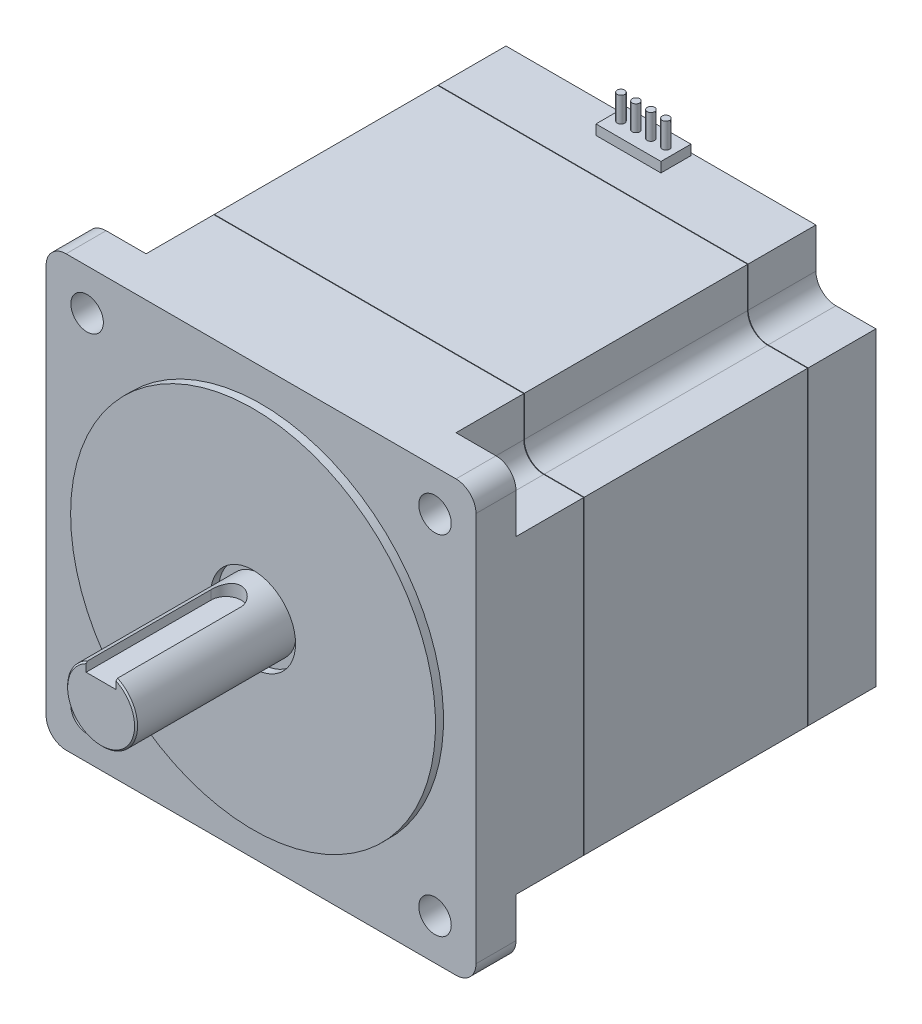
ISO-10303-21;
HEADER;
FILE_DESCRIPTION(('STEP AP214'),'2;1');
FILE_NAME('part.step','',(''),(''),'','','');
FILE_SCHEMA(('AUTOMOTIVE_DESIGN { 1 0 10303 214 1 1 1 1 }'));
ENDSEC;
DATA;
#1=APPLICATION_CONTEXT('core data for automotive mechanical design processes');
#2=APPLICATION_PROTOCOL_DEFINITION('international standard','automotive_design',2000,#1);
#3=PRODUCT_CONTEXT('',#1,'mechanical');
#4=PRODUCT('Part','Part','',(#3));
#5=PRODUCT_RELATED_PRODUCT_CATEGORY('part','',(#4));
#6=PRODUCT_DEFINITION_FORMATION('','',#4);
#7=PRODUCT_DEFINITION_CONTEXT('part definition',#1,'design');
#8=PRODUCT_DEFINITION('design','',#6,#7);
#9=PRODUCT_DEFINITION_SHAPE('','',#8);
#10=(LENGTH_UNIT() NAMED_UNIT(*) SI_UNIT(.MILLI.,.METRE.));
#11=(NAMED_UNIT(*) PLANE_ANGLE_UNIT() SI_UNIT($,.RADIAN.));
#12=(NAMED_UNIT(*) SI_UNIT($,.STERADIAN.) SOLID_ANGLE_UNIT());
#13=UNCERTAINTY_MEASURE_WITH_UNIT(LENGTH_MEASURE(1.E-05),#10,'distance_accuracy_value','');
#14=(GEOMETRIC_REPRESENTATION_CONTEXT(3) GLOBAL_UNCERTAINTY_ASSIGNED_CONTEXT((#13)) GLOBAL_UNIT_ASSIGNED_CONTEXT((#10,
#11,#12)) REPRESENTATION_CONTEXT('',''));
#15=CARTESIAN_POINT('',(0.,0.,0.));
#16=DIRECTION('',(0.,0.,1.));
#17=DIRECTION('',(1.,0.,0.));
#18=AXIS2_PLACEMENT_3D('',#15,#16,#17);
#19=CARTESIAN_POINT('',(-3.,4.5,87.));
#20=DIRECTION('',(0.,-1.,0.));
#21=DIRECTION('',(0.,0.,-1.));
#22=AXIS2_PLACEMENT_3D('',#19,#20,#21);
#23=PLANE('',#22);
#24=DIRECTION('',(0.,0.,-1.));
#25=VECTOR('',#24,1.);
#26=CARTESIAN_POINT('',(3.,4.5,87.));
#27=LINE('',#26,#25);
#28=CARTESIAN_POINT('',(3.,4.5,112.));
#29=VERTEX_POINT('',#28);
#30=CARTESIAN_POINT('',(3.,4.5,87.));
#31=VERTEX_POINT('',#30);
#32=EDGE_CURVE('P0_E370',#29,#31,#27,.T.);
#33=ORIENTED_EDGE('',*,*,#32,.T.);
#34=CARTESIAN_POINT('',(0.,4.5,87.));
#35=DIRECTION('',(0.,-1.,0.));
#36=DIRECTION('',(0.,0.,-1.));
#37=AXIS2_PLACEMENT_3D('',#34,#35,#36);
#38=CIRCLE('',#37,3.);
#39=CARTESIAN_POINT('',(-3.,4.5,87.));
#40=VERTEX_POINT('',#39);
#41=EDGE_CURVE('P0_E369',#31,#40,#38,.F.);
#42=ORIENTED_EDGE('',*,*,#41,.T.);
#43=DIRECTION('',(0.,0.,1.));
#44=VECTOR('',#43,1.);
#45=CARTESIAN_POINT('',(-3.,4.5,87.));
#46=LINE('',#45,#44);
#47=CARTESIAN_POINT('',(-3.,4.5,112.));
#48=VERTEX_POINT('',#47);
#49=EDGE_CURVE('P0_E236',#40,#48,#46,.T.);
#50=ORIENTED_EDGE('',*,*,#49,.T.);
#51=DIRECTION('',(1.,0.,0.));
#52=VECTOR('',#51,1.);
#53=CARTESIAN_POINT('',(0.,4.5,112.));
#54=LINE('',#53,#52);
#55=EDGE_CURVE('P0_E235',#29,#48,#54,.F.);
#56=ORIENTED_EDGE('',*,*,#55,.F.);
#57=EDGE_LOOP('',(#33,#42,#50,#56));
#58=FACE_BOUND('',#57,.T.);
#59=ADVANCED_FACE('P0_F17',(#58),#23,.F.);
#60=CARTESIAN_POINT('',(0.,0.,112.));
#61=DIRECTION('',(0.,0.,1.));
#62=DIRECTION('',(1.,0.,0.));
#63=AXIS2_PLACEMENT_3D('',#60,#61,#62);
#64=PLANE('',#63);
#65=DIRECTION('',(0.,1.,0.));
#66=VECTOR('',#65,1.);
#67=CARTESIAN_POINT('',(3.,4.5,112.));
#68=LINE('',#67,#66);
#69=CARTESIAN_POINT('',(3.,5.99082632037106,112.00000000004));
#70=VERTEX_POINT('',#69);
#71=EDGE_CURVE('P0_E222',#70,#29,#68,.F.);
#72=ORIENTED_EDGE('',*,*,#71,.T.);
#73=ORIENTED_EDGE('',*,*,#55,.T.);
#74=DIRECTION('',(0.,1.,0.));
#75=VECTOR('',#74,1.);
#76=CARTESIAN_POINT('',(-3.,4.5,112.));
#77=LINE('',#76,#75);
#78=CARTESIAN_POINT('',(-3.,5.99082632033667,112.000000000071));
#79=VERTEX_POINT('',#78);
#80=EDGE_CURVE('P0_E228',#48,#79,#77,.T.);
#81=ORIENTED_EDGE('',*,*,#80,.T.);
#82=CARTESIAN_POINT('',(0.,0.,112.00000000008));
#83=DIRECTION('',(0.,0.,-1.));
#84=DIRECTION('',(-1.,0.,0.));
#85=AXIS2_PLACEMENT_3D('',#82,#83,#84);
#86=CIRCLE('',#85,6.70000000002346);
#87=EDGE_CURVE('P0_E211',#70,#79,#86,.T.);
#88=ORIENTED_EDGE('',*,*,#87,.F.);
#89=EDGE_LOOP('',(#72,#73,#81,#88));
#90=FACE_BOUND('',#89,.T.);
#91=ADVANCED_FACE('P0_F233',(#90),#64,.T.);
#92=CARTESIAN_POINT('',(-3.,4.5,87.));
#93=DIRECTION('',(-1.,0.,0.));
#94=DIRECTION('',(0.,0.,1.));
#95=AXIS2_PLACEMENT_3D('',#92,#93,#94);
#96=PLANE('',#95);
#97=CARTESIAN_POINT('',(-3.,5.99082632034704,112.000000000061));
#98=CARTESIAN_POINT('',(-3.,6.04657710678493,111.95014381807));
#99=CARTESIAN_POINT('',(-3.,6.1022632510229,111.900215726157));
#100=CARTESIAN_POINT('',(-3.,6.21350625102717,111.800215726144));
#101=CARTESIAN_POINT('',(-3.,6.26906310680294,111.750143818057));
#102=CARTESIAN_POINT('',(-3.,6.32455532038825,111.700000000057));
#103=B_SPLINE_CURVE_WITH_KNOTS('',3,(#97,#98,#99,#100,#101,#102),.UNSPECIFIED.,.F.,.F.,(4,2,4),
(0.,0.224374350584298,0.448748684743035),.UNSPECIFIED.);
#104=CARTESIAN_POINT('',(-3.,6.3245553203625,111.700000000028));
#105=VERTEX_POINT('',#104);
#106=EDGE_CURVE('P0_E20',#79,#105,#103,.T.);
#107=ORIENTED_EDGE('',*,*,#106,.F.);
#108=ORIENTED_EDGE('',*,*,#80,.F.);
#109=ORIENTED_EDGE('',*,*,#49,.F.);
#110=DIRECTION('',(0.,-1.,0.));
#111=VECTOR('',#110,1.);
#112=CARTESIAN_POINT('',(-3.,43.0000000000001,87.));
#113=LINE('',#112,#111);
#114=CARTESIAN_POINT('',(-3.,6.32455532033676,87.));
#115=VERTEX_POINT('',#114);
#116=EDGE_CURVE('P0_E232',#40,#115,#113,.F.);
#117=ORIENTED_EDGE('',*,*,#116,.T.);
#118=DIRECTION('',(0.,0.,-1.));
#119=VECTOR('',#118,1.);
#120=CARTESIAN_POINT('',(-3.,6.32455532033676,112.));
#121=LINE('',#120,#119);
#122=EDGE_CURVE('P0_E221',#105,#115,#121,.T.);
#123=ORIENTED_EDGE('',*,*,#122,.F.);
#124=EDGE_LOOP('',(#107,#108,#109,#117,#123));
#125=FACE_BOUND('',#124,.T.);
#126=ADVANCED_FACE('P0_F226',(#125),#96,.F.);
#127=CARTESIAN_POINT('',(0.,43.0000000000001,87.));
#128=DIRECTION('',(0.,-1.,0.));
#129=DIRECTION('',(0.,0.,-1.));
#130=AXIS2_PLACEMENT_3D('',#127,#128,#129);
#131=CYLINDRICAL_SURFACE('',#130,3.);
#132=CARTESIAN_POINT('',(-3.,6.32455532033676,87.));
#133=CARTESIAN_POINT('',(-3.00001254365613,6.32453705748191,86.9198488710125));
#134=CARTESIAN_POINT('',(-2.9967882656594,6.32607850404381,86.8397077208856));
#135=CARTESIAN_POINT('',(-2.9839642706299,6.33214408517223,86.6800849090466));
#136=CARTESIAN_POINT('',(-2.97436734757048,6.33666691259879,86.6006029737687));
#137=CARTESIAN_POINT('',(-2.94895223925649,6.34853254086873,86.4432144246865));
#138=CARTESIAN_POINT('',(-2.93316165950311,6.35586282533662,86.3653024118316));
#139=CARTESIAN_POINT('',(-2.89554446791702,6.37308783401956,86.2112563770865));
#140=CARTESIAN_POINT('',(-2.87371740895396,6.38298274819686,86.1351224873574));
#141=CARTESIAN_POINT('',(-2.79955079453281,6.41603222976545,85.9103513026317));
#142=CARTESIAN_POINT('',(-2.73846802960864,6.44258026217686,85.7649927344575));
#143=CARTESIAN_POINT('',(-2.59499047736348,6.5016933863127,85.4865130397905));
#144=CARTESIAN_POINT('',(-2.5125724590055,6.53426502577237,85.3534054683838));
#145=CARTESIAN_POINT('',(-2.32303431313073,6.6041115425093,85.0945542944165));
#146=CARTESIAN_POINT('',(-2.21474157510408,6.64155064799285,84.9697117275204));
#147=CARTESIAN_POINT('',(-1.97898550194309,6.71556929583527,84.7392915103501));
#148=CARTESIAN_POINT('',(-1.85151527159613,6.75214852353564,84.6337208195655));
#149=CARTESIAN_POINT('',(-1.57372168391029,6.82237882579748,84.4400422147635));
#150=CARTESIAN_POINT('',(-1.42260803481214,6.85581277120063,84.3529826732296));
#151=CARTESIAN_POINT('',(-1.10626010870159,6.91389405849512,84.2059856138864));
#152=CARTESIAN_POINT('',(-0.941044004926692,6.93855250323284,84.1460137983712));
#153=CARTESIAN_POINT('',(-0.646111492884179,6.97126052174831,84.067533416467));
#154=CARTESIAN_POINT('',(-0.518448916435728,6.98196994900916,84.0422755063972));
#155=CARTESIAN_POINT('',(-0.260537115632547,6.99634113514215,84.0085076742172));
#156=CARTESIAN_POINT('',(-0.130288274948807,7.00000393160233,83.9999952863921));
#157=CARTESIAN_POINT('',(0.160549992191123,6.99999515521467,84.0000058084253));
#158=CARTESIAN_POINT('',(0.32115986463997,6.99442244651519,84.0129446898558));
#159=CARTESIAN_POINT('',(0.637601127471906,6.97270959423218,84.0641525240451));
#160=CARTESIAN_POINT('',(0.793429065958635,6.95656199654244,84.1024393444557));
#161=CARTESIAN_POINT('',(1.09550948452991,6.91542096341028,84.2026584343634));
#162=CARTESIAN_POINT('',(1.24178723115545,6.89045209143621,84.2645250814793));
#163=CARTESIAN_POINT('',(1.52181125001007,6.83407061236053,84.4098272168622));
#164=CARTESIAN_POINT('',(1.65555532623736,6.80265687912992,84.4932664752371));
#165=CARTESIAN_POINT('',(1.91384294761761,6.73467799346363,84.6839280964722));
#166=CARTESIAN_POINT('',(2.03764209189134,6.69793847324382,84.7920959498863));
#167=CARTESIAN_POINT('',(2.26599158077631,6.62417612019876,85.0271460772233));
#168=CARTESIAN_POINT('',(2.37053147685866,6.58715314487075,85.1540384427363));
#169=CARTESIAN_POINT('',(2.56290495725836,6.51480223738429,85.4310998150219));
#170=CARTESIAN_POINT('',(2.64955184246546,6.47966968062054,85.5821487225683));
#171=CARTESIAN_POINT('',(2.79579228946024,6.41793579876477,85.8982823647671));
#172=CARTESIAN_POINT('',(2.85542690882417,6.39132154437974,86.0633453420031));
#173=CARTESIAN_POINT('',(2.93318733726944,6.35591858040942,86.3573721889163));
#174=CARTESIAN_POINT('',(2.95814548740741,6.34426746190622,86.4842031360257));
#175=CARTESIAN_POINT('',(2.98320565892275,6.33250047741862,86.6764592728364));
#176=CARTESIAN_POINT('',(2.9894962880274,6.32952965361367,86.7409498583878));
#177=CARTESIAN_POINT('',(2.99789576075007,6.32555376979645,86.8702874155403));
#178=CARTESIAN_POINT('',(3.00000301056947,6.32454945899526,86.9351345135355));
#179=CARTESIAN_POINT('',(3.,6.32455532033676,87.));
#180=B_SPLINE_CURVE_WITH_KNOTS('',3,(#132,#133,#134,#135,#136,#137,#138,#139,#140,#141,#142,
#143,#144,#145,#146,#147,#148,#149,#150,#151,#152,#153,#154,#155,#156,#157,#158,#159,#160,#161,
#162,#163,#164,#165,#166,#167,#168,#169,#170,#171,#172,#173,#174,#175,#176,#177,#178,#179),
.UNSPECIFIED.,.F.,.F.,(4,2,2,2,2,2,2,2,2,2,2,2,2,2,2,2,2,2,2,2,2,2,2,4),(0.,0.240357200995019,
0.480609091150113,0.719802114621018,0.959012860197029,1.43637496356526,1.91425904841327,
2.42040481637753,2.9267330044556,3.45675530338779,3.98610460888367,4.376622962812,
4.76708381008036,5.2482359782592,5.72972767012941,6.20988904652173,6.69013439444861,
7.19331431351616,7.69676641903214,8.22703925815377,8.75650337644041,9.14455775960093,
9.33900251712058,9.53352134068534),.UNSPECIFIED.);
#181=CARTESIAN_POINT('',(3.,6.32455532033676,87.));
#182=VERTEX_POINT('',#181);
#183=EDGE_CURVE('P0_E342',#115,#182,#180,.T.);
#184=ORIENTED_EDGE('',*,*,#183,.F.);
#185=ORIENTED_EDGE('',*,*,#116,.F.);
#186=ORIENTED_EDGE('',*,*,#41,.F.);
#187=DIRECTION('',(0.,1.,0.));
#188=VECTOR('',#187,1.);
#189=CARTESIAN_POINT('',(3.,4.5,87.));
#190=LINE('',#189,#188);
#191=EDGE_CURVE('P0_E368',#31,#182,#190,.T.);
#192=ORIENTED_EDGE('',*,*,#191,.T.);
#193=EDGE_LOOP('',(#184,#185,#186,#192));
#194=FACE_BOUND('',#193,.T.);
#195=ADVANCED_FACE('P0_F350',(#194),#131,.F.);
#196=CARTESIAN_POINT('',(3.,4.5,87.));
#197=DIRECTION('',(1.,0.,0.));
#198=DIRECTION('',(0.,0.,-1.));
#199=AXIS2_PLACEMENT_3D('',#196,#197,#198);
#200=PLANE('',#199);
#201=CARTESIAN_POINT('',(3.,6.32455532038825,111.700000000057));
#202=CARTESIAN_POINT('',(3.,6.26906310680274,111.750143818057));
#203=CARTESIAN_POINT('',(3.,6.21350625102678,111.800215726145));
#204=CARTESIAN_POINT('',(3.,6.10226325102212,111.900215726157));
#205=CARTESIAN_POINT('',(3.,6.04657710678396,111.950143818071));
#206=CARTESIAN_POINT('',(3.,5.99082632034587,112.000000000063));
#207=B_SPLINE_CURVE_WITH_KNOTS('',3,(#201,#202,#203,#204,#205,#206),.UNSPECIFIED.,.F.,.F.,(4,2,
4),(0.,0.224374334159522,0.448748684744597),.UNSPECIFIED.);
#208=CARTESIAN_POINT('',(3.,6.3245553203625,111.700000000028));
#209=VERTEX_POINT('',#208);
#210=EDGE_CURVE('P0_E216',#209,#70,#207,.T.);
#211=ORIENTED_EDGE('',*,*,#210,.F.);
#212=DIRECTION('',(0.,0.,-1.));
#213=VECTOR('',#212,1.);
#214=CARTESIAN_POINT('',(3.,6.32455532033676,112.));
#215=LINE('',#214,#213);
#216=EDGE_CURVE('P0_E348',#182,#209,#215,.F.);
#217=ORIENTED_EDGE('',*,*,#216,.F.);
#218=ORIENTED_EDGE('',*,*,#191,.F.);
#219=ORIENTED_EDGE('',*,*,#32,.F.);
#220=ORIENTED_EDGE('',*,*,#71,.F.);
#221=EDGE_LOOP('',(#211,#217,#218,#219,#220));
#222=FACE_BOUND('',#221,.T.);
#223=ADVANCED_FACE('P0_F362',(#222),#200,.F.);
#224=CARTESIAN_POINT('',(0.,0.,111.700000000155));
#225=DIRECTION('',(0.,0.,-1.));
#226=DIRECTION('',(-1.,0.,0.));
#227=AXIS2_PLACEMENT_3D('',#224,#225,#226);
#228=CONICAL_SURFACE('',#227,6.99999999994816,0.785398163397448);
#229=ORIENTED_EDGE('',*,*,#87,.T.);
#230=ORIENTED_EDGE('',*,*,#106,.T.);
#231=CARTESIAN_POINT('',(0.,0.,111.7));
#232=DIRECTION('',(0.,0.,-1.));
#233=DIRECTION('',(-1.,0.,0.));
#234=AXIS2_PLACEMENT_3D('',#231,#232,#233);
#235=CIRCLE('',#234,7.);
#236=EDGE_CURVE('P0_E341',#209,#105,#235,.T.);
#237=ORIENTED_EDGE('',*,*,#236,.F.);
#238=ORIENTED_EDGE('',*,*,#210,.T.);
#239=EDGE_LOOP('',(#229,#230,#237,#238));
#240=FACE_BOUND('',#239,.T.);
#241=ADVANCED_FACE('P0_F213',(#240),#228,.T.);
#242=CARTESIAN_POINT('',(0.,0.,112.));
#243=DIRECTION('',(0.,0.,-1.));
#244=DIRECTION('',(-1.,0.,0.));
#245=AXIS2_PLACEMENT_3D('',#242,#243,#244);
#246=CYLINDRICAL_SURFACE('',#245,7.);
#247=ORIENTED_EDGE('',*,*,#216,.T.);
#248=ORIENTED_EDGE('',*,*,#236,.T.);
#249=ORIENTED_EDGE('',*,*,#122,.T.);
#250=ORIENTED_EDGE('',*,*,#183,.T.);
#251=EDGE_LOOP('',(#247,#248,#249,#250));
#252=FACE_BOUND('',#251,.T.);
#253=CARTESIAN_POINT('',(0.,0.,80.));
#254=DIRECTION('',(0.,0.,-1.));
#255=DIRECTION('',(-1.,0.,0.));
#256=AXIS2_PLACEMENT_3D('',#253,#254,#255);
#257=CIRCLE('',#256,7.);
#258=CARTESIAN_POINT('',(-7.,0.,80.));
#259=VERTEX_POINT('',#258);
#260=EDGE_CURVE('P0_E338',#259,#259,#257,.F.);
#261=ORIENTED_EDGE('',*,*,#260,.T.);
#262=EDGE_LOOP('',(#261));
#263=FACE_BOUND('',#262,.T.);
#264=ADVANCED_FACE('P0_F353',(#252,#263),#246,.T.);
#265=CARTESIAN_POINT('',(31.0000000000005,-30.9999999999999,80.));
#266=DIRECTION('',(0.,0.,-1.));
#267=DIRECTION('',(-1.,0.,0.));
#268=AXIS2_PLACEMENT_3D('',#265,#266,#267);
#269=PLANE('',#268);
#270=ORIENTED_EDGE('',*,*,#260,.F.);
#271=EDGE_LOOP('',(#270));
#272=FACE_BOUND('',#271,.T.);
#273=CARTESIAN_POINT('',(0.,0.,80.));
#274=DIRECTION('',(0.,0.,1.));
#275=DIRECTION('',(1.,0.,0.));
#276=AXIS2_PLACEMENT_3D('',#273,#274,#275);
#277=CIRCLE('',#276,8.5);
#278=CARTESIAN_POINT('',(8.5,0.,80.));
#279=VERTEX_POINT('',#278);
#280=EDGE_CURVE('P0_E335',#279,#279,#277,.T.);
#281=ORIENTED_EDGE('',*,*,#280,.T.);
#282=EDGE_LOOP('',(#281));
#283=FACE_BOUND('',#282,.T.);
#284=ADVANCED_FACE('P0_F357',(#272,#283),#269,.F.);
#285=CARTESIAN_POINT('',(0.,0.,55.9583694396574));
#286=DIRECTION('',(0.,0.,1.));
#287=DIRECTION('',(1.,0.,0.));
#288=AXIS2_PLACEMENT_3D('',#285,#286,#287);
#289=CYLINDRICAL_SURFACE('',#288,8.5);
#290=CARTESIAN_POINT('',(0.,0.,81.6));
#291=DIRECTION('',(0.,0.,1.));
#292=DIRECTION('',(1.,0.,0.));
#293=AXIS2_PLACEMENT_3D('',#290,#291,#292);
#294=CIRCLE('',#293,8.5);
#295=CARTESIAN_POINT('',(8.5,0.,81.6));
#296=VERTEX_POINT('',#295);
#297=EDGE_CURVE('P0_E332',#296,#296,#294,.F.);
#298=ORIENTED_EDGE('',*,*,#297,.F.);
#299=EDGE_LOOP('',(#298));
#300=FACE_BOUND('',#299,.T.);
#301=ORIENTED_EDGE('',*,*,#280,.F.);
#302=EDGE_LOOP('',(#301));
#303=FACE_BOUND('',#302,.T.);
#304=ADVANCED_FACE('P0_F769',(#300,#303),#289,.F.);
#305=CARTESIAN_POINT('',(0.,0.,81.6));
#306=DIRECTION('',(0.,0.,1.));
#307=DIRECTION('',(1.,0.,0.));
#308=AXIS2_PLACEMENT_3D('',#305,#306,#307);
#309=PLANE('',#308);
#310=CARTESIAN_POINT('',(0.,0.,81.6));
#311=DIRECTION('',(0.,0.,-1.));
#312=DIRECTION('',(-1.,0.,0.));
#313=AXIS2_PLACEMENT_3D('',#310,#311,#312);
#314=CIRCLE('',#313,36.5);
#315=CARTESIAN_POINT('',(-36.5,0.,81.6));
#316=VERTEX_POINT('',#315);
#317=EDGE_CURVE('P0_E329',#316,#316,#314,.T.);
#318=ORIENTED_EDGE('',*,*,#317,.F.);
#319=EDGE_LOOP('',(#318));
#320=FACE_BOUND('',#319,.T.);
#321=ORIENTED_EDGE('',*,*,#297,.T.);
#322=EDGE_LOOP('',(#321));
#323=FACE_BOUND('',#322,.T.);
#324=ADVANCED_FACE('P0_F766',(#320,#323),#309,.T.);
#325=CARTESIAN_POINT('',(-34.8,-34.8,0.));
#326=DIRECTION('',(0.,0.,1.));
#327=DIRECTION('',(1.,0.,0.));
#328=AXIS2_PLACEMENT_3D('',#325,#326,#327);
#329=CYLINDRICAL_SURFACE('',#328,3.25);
#330=CARTESIAN_POINT('',(-34.8,-34.8,72.));
#331=DIRECTION('',(0.,0.,1.));
#332=DIRECTION('',(1.,0.,0.));
#333=AXIS2_PLACEMENT_3D('',#330,#331,#332);
#334=CIRCLE('',#333,3.25);
#335=CARTESIAN_POINT('',(-31.55,-34.8,72.));
#336=VERTEX_POINT('',#335);
#337=EDGE_CURVE('P0_E311',#336,#336,#334,.F.);
#338=ORIENTED_EDGE('',*,*,#337,.T.);
#339=EDGE_LOOP('',(#338));
#340=FACE_BOUND('',#339,.T.);
#341=CARTESIAN_POINT('',(-34.8,-34.8,80.));
#342=DIRECTION('',(0.,0.,1.));
#343=DIRECTION('',(1.,0.,0.));
#344=AXIS2_PLACEMENT_3D('',#341,#342,#343);
#345=CIRCLE('',#344,3.25);
#346=CARTESIAN_POINT('',(-31.55,-34.8,80.));
#347=VERTEX_POINT('',#346);
#348=EDGE_CURVE('P0_E306',#347,#347,#345,.T.);
#349=ORIENTED_EDGE('',*,*,#348,.T.);
#350=EDGE_LOOP('',(#349));
#351=FACE_BOUND('',#350,.T.);
#352=ADVANCED_FACE('P0_F762',(#340,#351),#329,.F.);
#353=CARTESIAN_POINT('',(34.8,-34.8,0.));
#354=DIRECTION('',(0.,0.,1.));
#355=DIRECTION('',(1.,0.,0.));
#356=AXIS2_PLACEMENT_3D('',#353,#354,#355);
#357=CYLINDRICAL_SURFACE('',#356,3.25);
#358=CARTESIAN_POINT('',(34.8,-34.8,72.));
#359=DIRECTION('',(0.,0.,1.));
#360=DIRECTION('',(1.,0.,0.));
#361=AXIS2_PLACEMENT_3D('',#358,#359,#360);
#362=CIRCLE('',#361,3.25);
#363=CARTESIAN_POINT('',(38.05,-34.8,72.));
#364=VERTEX_POINT('',#363);
#365=EDGE_CURVE('P0_E316',#364,#364,#362,.F.);
#366=ORIENTED_EDGE('',*,*,#365,.T.);
#367=EDGE_LOOP('',(#366));
#368=FACE_BOUND('',#367,.T.);
#369=CARTESIAN_POINT('',(34.8,-34.8,80.));
#370=DIRECTION('',(0.,0.,1.));
#371=DIRECTION('',(1.,0.,0.));
#372=AXIS2_PLACEMENT_3D('',#369,#370,#371);
#373=CIRCLE('',#372,3.25);
#374=CARTESIAN_POINT('',(38.05,-34.8,80.));
#375=VERTEX_POINT('',#374);
#376=EDGE_CURVE('P0_E303',#375,#375,#373,.T.);
#377=ORIENTED_EDGE('',*,*,#376,.T.);
#378=EDGE_LOOP('',(#377));
#379=FACE_BOUND('',#378,.T.);
#380=ADVANCED_FACE('P0_F758',(#368,#379),#357,.F.);
#381=CARTESIAN_POINT('',(34.8,34.8,0.));
#382=DIRECTION('',(0.,0.,1.));
#383=DIRECTION('',(1.,0.,0.));
#384=AXIS2_PLACEMENT_3D('',#381,#382,#383);
#385=CYLINDRICAL_SURFACE('',#384,3.25);
#386=CARTESIAN_POINT('',(34.8,34.8,72.));
#387=DIRECTION('',(0.,0.,1.));
#388=DIRECTION('',(1.,0.,0.));
#389=AXIS2_PLACEMENT_3D('',#386,#387,#388);
#390=CIRCLE('',#389,3.25);
#391=CARTESIAN_POINT('',(38.05,34.8,72.));
#392=VERTEX_POINT('',#391);
#393=EDGE_CURVE('P0_E326',#392,#392,#390,.F.);
#394=ORIENTED_EDGE('',*,*,#393,.T.);
#395=EDGE_LOOP('',(#394));
#396=FACE_BOUND('',#395,.T.);
#397=CARTESIAN_POINT('',(34.8,34.8,80.));
#398=DIRECTION('',(0.,0.,1.));
#399=DIRECTION('',(1.,0.,0.));
#400=AXIS2_PLACEMENT_3D('',#397,#398,#399);
#401=CIRCLE('',#400,3.25);
#402=CARTESIAN_POINT('',(38.05,34.8,80.));
#403=VERTEX_POINT('',#402);
#404=EDGE_CURVE('P0_E300',#403,#403,#401,.T.);
#405=ORIENTED_EDGE('',*,*,#404,.T.);
#406=EDGE_LOOP('',(#405));
#407=FACE_BOUND('',#406,.T.);
#408=ADVANCED_FACE('P0_F754',(#396,#407),#385,.F.);
#409=CARTESIAN_POINT('',(-34.8,34.8,0.));
#410=DIRECTION('',(0.,0.,1.));
#411=DIRECTION('',(1.,0.,0.));
#412=AXIS2_PLACEMENT_3D('',#409,#410,#411);
#413=CYLINDRICAL_SURFACE('',#412,3.25);
#414=CARTESIAN_POINT('',(-34.8,34.8,72.));
#415=DIRECTION('',(0.,0.,1.));
#416=DIRECTION('',(1.,0.,0.));
#417=AXIS2_PLACEMENT_3D('',#414,#415,#416);
#418=CIRCLE('',#417,3.25);
#419=CARTESIAN_POINT('',(-31.55,34.8,72.));
#420=VERTEX_POINT('',#419);
#421=EDGE_CURVE('P0_E321',#420,#420,#418,.F.);
#422=ORIENTED_EDGE('',*,*,#421,.T.);
#423=EDGE_LOOP('',(#422));
#424=FACE_BOUND('',#423,.T.);
#425=CARTESIAN_POINT('',(-34.8,34.8,80.));
#426=DIRECTION('',(0.,0.,1.));
#427=DIRECTION('',(1.,0.,0.));
#428=AXIS2_PLACEMENT_3D('',#425,#426,#427);
#429=CIRCLE('',#428,3.25);
#430=CARTESIAN_POINT('',(-31.55,34.8,80.));
#431=VERTEX_POINT('',#430);
#432=EDGE_CURVE('P0_E297',#431,#431,#429,.T.);
#433=ORIENTED_EDGE('',*,*,#432,.T.);
#434=EDGE_LOOP('',(#433));
#435=FACE_BOUND('',#434,.T.);
#436=ADVANCED_FACE('P0_F750',(#424,#435),#413,.F.);
#437=CARTESIAN_POINT('',(0.,0.,81.6));
#438=DIRECTION('',(0.,0.,-1.));
#439=DIRECTION('',(-1.,0.,0.));
#440=AXIS2_PLACEMENT_3D('',#437,#438,#439);
#441=CYLINDRICAL_SURFACE('',#440,36.5);
#442=ORIENTED_EDGE('',*,*,#317,.T.);
#443=EDGE_LOOP('',(#442));
#444=FACE_BOUND('',#443,.T.);
#445=CARTESIAN_POINT('',(0.,0.,80.));
#446=DIRECTION('',(0.,0.,-1.));
#447=DIRECTION('',(-1.,0.,0.));
#448=AXIS2_PLACEMENT_3D('',#445,#446,#447);
#449=CIRCLE('',#448,36.5);
#450=CARTESIAN_POINT('',(-36.5,0.,80.));
#451=VERTEX_POINT('',#450);
#452=EDGE_CURVE('P0_E283',#451,#451,#449,.F.);
#453=ORIENTED_EDGE('',*,*,#452,.T.);
#454=EDGE_LOOP('',(#453));
#455=FACE_BOUND('',#454,.T.);
#456=ADVANCED_FACE('P0_F746',(#444,#455),#441,.T.);
#457=CARTESIAN_POINT('',(-43.,-43.,72.));
#458=DIRECTION('',(0.,0.,1.));
#459=DIRECTION('',(1.,0.,0.));
#460=AXIS2_PLACEMENT_3D('',#457,#458,#459);
#461=PLANE('',#460);
#462=CARTESIAN_POINT('',(38.9999999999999,39.,72.));
#463=DIRECTION('',(0.,0.,1.));
#464=DIRECTION('',(1.,0.,0.));
#465=AXIS2_PLACEMENT_3D('',#462,#463,#464);
#466=CIRCLE('',#465,4.);
#467=CARTESIAN_POINT('',(42.9999999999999,39.,72.));
#468=VERTEX_POINT('',#467);
#469=CARTESIAN_POINT('',(38.9999999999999,43.,72.));
#470=VERTEX_POINT('',#469);
#471=EDGE_CURVE('P0_E324',#468,#470,#466,.T.);
#472=ORIENTED_EDGE('',*,*,#471,.F.);
#473=DIRECTION('',(0.,-1.,0.));
#474=VECTOR('',#473,1.);
#475=CARTESIAN_POINT('',(42.9999999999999,30.9999999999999,72.));
#476=LINE('',#475,#474);
#477=CARTESIAN_POINT('',(42.9999999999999,30.9999999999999,72.));
#478=VERTEX_POINT('',#477);
#479=EDGE_CURVE('P0_E413',#468,#478,#476,.T.);
#480=ORIENTED_EDGE('',*,*,#479,.T.);
#481=DIRECTION('',(1.,0.,0.));
#482=VECTOR('',#481,1.);
#483=CARTESIAN_POINT('',(30.9999999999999,30.9999999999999,72.));
#484=LINE('',#483,#482);
#485=CARTESIAN_POINT('',(34.9999999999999,30.9999999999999,72.));
#486=VERTEX_POINT('',#485);
#487=EDGE_CURVE('P0_E417',#478,#486,#484,.F.);
#488=ORIENTED_EDGE('',*,*,#487,.T.);
#489=CARTESIAN_POINT('',(34.9999999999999,35.,72.));
#490=DIRECTION('',(0.,0.,1.));
#491=DIRECTION('',(1.,0.,0.));
#492=AXIS2_PLACEMENT_3D('',#489,#490,#491);
#493=CIRCLE('',#492,4.);
#494=CARTESIAN_POINT('',(30.9999999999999,34.9999999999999,72.));
#495=VERTEX_POINT('',#494);
#496=EDGE_CURVE('P0_E273',#486,#495,#493,.F.);
#497=ORIENTED_EDGE('',*,*,#496,.T.);
#498=DIRECTION('',(0.,-1.,0.));
#499=VECTOR('',#498,1.);
#500=CARTESIAN_POINT('',(30.9999999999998,43.,72.));
#501=LINE('',#500,#499);
#502=CARTESIAN_POINT('',(30.9999999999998,43.,72.));
#503=VERTEX_POINT('',#502);
#504=EDGE_CURVE('P0_E430',#495,#503,#501,.F.);
#505=ORIENTED_EDGE('',*,*,#504,.T.);
#506=DIRECTION('',(1.,0.,0.));
#507=VECTOR('',#506,1.);
#508=CARTESIAN_POINT('',(-31.0000000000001,43.,72.));
#509=LINE('',#508,#507);
#510=EDGE_CURVE('P0_E435',#503,#470,#509,.T.);
#511=ORIENTED_EDGE('',*,*,#510,.T.);
#512=EDGE_LOOP('',(#472,#480,#488,#497,#505,#511));
#513=FACE_BOUND('',#512,.T.);
#514=ORIENTED_EDGE('',*,*,#393,.F.);
#515=EDGE_LOOP('',(#514));
#516=FACE_BOUND('',#515,.T.);
#517=ADVANCED_FACE('P0_F742',(#513,#516),#461,.F.);
#518=CARTESIAN_POINT('',(38.9999999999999,39.,80.));
#519=DIRECTION('',(0.,0.,1.));
#520=DIRECTION('',(1.,0.,0.));
#521=AXIS2_PLACEMENT_3D('',#518,#519,#520);
#522=CYLINDRICAL_SURFACE('',#521,4.);
#523=CARTESIAN_POINT('',(38.9999999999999,39.,80.));
#524=DIRECTION('',(0.,0.,1.));
#525=DIRECTION('',(1.,0.,0.));
#526=AXIS2_PLACEMENT_3D('',#523,#524,#525);
#527=CIRCLE('',#526,4.);
#528=CARTESIAN_POINT('',(38.9999999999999,43.,80.));
#529=VERTEX_POINT('',#528);
#530=CARTESIAN_POINT('',(42.9999999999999,39.,80.));
#531=VERTEX_POINT('',#530);
#532=EDGE_CURVE('P0_E291',#529,#531,#527,.F.);
#533=ORIENTED_EDGE('',*,*,#532,.T.);
#534=DIRECTION('',(0.,0.,1.));
#535=VECTOR('',#534,1.);
#536=CARTESIAN_POINT('',(42.9999999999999,39.,80.));
#537=LINE('',#536,#535);
#538=EDGE_CURVE('P0_E410',#531,#468,#537,.F.);
#539=ORIENTED_EDGE('',*,*,#538,.T.);
#540=ORIENTED_EDGE('',*,*,#471,.T.);
#541=DIRECTION('',(0.,0.,1.));
#542=VECTOR('',#541,1.);
#543=CARTESIAN_POINT('',(38.9999999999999,43.,80.));
#544=LINE('',#543,#542);
#545=EDGE_CURVE('P0_E438',#470,#529,#544,.T.);
#546=ORIENTED_EDGE('',*,*,#545,.T.);
#547=EDGE_LOOP('',(#533,#539,#540,#546));
#548=FACE_BOUND('',#547,.T.);
#549=ADVANCED_FACE('P0_F738',(#548),#522,.T.);
#550=CARTESIAN_POINT('',(-43.,-43.,72.));
#551=DIRECTION('',(0.,0.,1.));
#552=DIRECTION('',(1.,0.,0.));
#553=AXIS2_PLACEMENT_3D('',#550,#551,#552);
#554=PLANE('',#553);
#555=CARTESIAN_POINT('',(-39.0000000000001,39.,72.));
#556=DIRECTION('',(0.,0.,1.));
#557=DIRECTION('',(1.,0.,0.));
#558=AXIS2_PLACEMENT_3D('',#555,#556,#557);
#559=CIRCLE('',#558,4.);
#560=CARTESIAN_POINT('',(-39.0000000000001,43.,72.));
#561=VERTEX_POINT('',#560);
#562=CARTESIAN_POINT('',(-43.0000000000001,39.,72.));
#563=VERTEX_POINT('',#562);
#564=EDGE_CURVE('P0_E319',#561,#563,#559,.T.);
#565=ORIENTED_EDGE('',*,*,#564,.F.);
#566=DIRECTION('',(1.,0.,0.));
#567=VECTOR('',#566,1.);
#568=CARTESIAN_POINT('',(-31.0000000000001,43.,72.));
#569=LINE('',#568,#567);
#570=CARTESIAN_POINT('',(-31.0000000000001,43.0000000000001,72.));
#571=VERTEX_POINT('',#570);
#572=EDGE_CURVE('P0_E443',#561,#571,#569,.T.);
#573=ORIENTED_EDGE('',*,*,#572,.T.);
#574=DIRECTION('',(0.,1.,0.));
#575=VECTOR('',#574,1.);
#576=CARTESIAN_POINT('',(-31.0000000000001,30.9999999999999,72.));
#577=LINE('',#576,#575);
#578=CARTESIAN_POINT('',(-31.0000000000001,34.9999999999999,72.));
#579=VERTEX_POINT('',#578);
#580=EDGE_CURVE('P0_E447',#571,#579,#577,.F.);
#581=ORIENTED_EDGE('',*,*,#580,.T.);
#582=CARTESIAN_POINT('',(-35.0000000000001,34.9999999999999,72.));
#583=DIRECTION('',(0.,0.,1.));
#584=DIRECTION('',(1.,0.,0.));
#585=AXIS2_PLACEMENT_3D('',#582,#583,#584);
#586=CIRCLE('',#585,4.);
#587=CARTESIAN_POINT('',(-35.0000000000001,30.9999999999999,72.));
#588=VERTEX_POINT('',#587);
#589=EDGE_CURVE('P0_E268',#579,#588,#586,.F.);
#590=ORIENTED_EDGE('',*,*,#589,.T.);
#591=DIRECTION('',(1.,0.,0.));
#592=VECTOR('',#591,1.);
#593=CARTESIAN_POINT('',(-43.0000000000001,30.9999999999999,72.));
#594=LINE('',#593,#592);
#595=CARTESIAN_POINT('',(-43.0000000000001,30.9999999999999,72.));
#596=VERTEX_POINT('',#595);
#597=EDGE_CURVE('P0_E460',#588,#596,#594,.F.);
#598=ORIENTED_EDGE('',*,*,#597,.T.);
#599=DIRECTION('',(0.,1.,0.));
#600=VECTOR('',#599,1.);
#601=CARTESIAN_POINT('',(-43.0000000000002,-30.9999999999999,72.));
#602=LINE('',#601,#600);
#603=EDGE_CURVE('P0_E465',#596,#563,#602,.T.);
#604=ORIENTED_EDGE('',*,*,#603,.T.);
#605=EDGE_LOOP('',(#565,#573,#581,#590,#598,#604));
#606=FACE_BOUND('',#605,.T.);
#607=ORIENTED_EDGE('',*,*,#421,.F.);
#608=EDGE_LOOP('',(#607));
#609=FACE_BOUND('',#608,.T.);
#610=ADVANCED_FACE('P0_F734',(#606,#609),#554,.F.);
#611=CARTESIAN_POINT('',(-39.0000000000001,39.,80.));
#612=DIRECTION('',(0.,0.,1.));
#613=DIRECTION('',(1.,0.,0.));
#614=AXIS2_PLACEMENT_3D('',#611,#612,#613);
#615=CYLINDRICAL_SURFACE('',#614,4.);
#616=CARTESIAN_POINT('',(-39.0000000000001,39.,80.));
#617=DIRECTION('',(0.,0.,1.));
#618=DIRECTION('',(1.,0.,0.));
#619=AXIS2_PLACEMENT_3D('',#616,#617,#618);
#620=CIRCLE('',#619,4.);
#621=CARTESIAN_POINT('',(-43.0000000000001,39.,80.));
#622=VERTEX_POINT('',#621);
#623=CARTESIAN_POINT('',(-39.0000000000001,43.,80.));
#624=VERTEX_POINT('',#623);
#625=EDGE_CURVE('P0_E294',#622,#624,#620,.F.);
#626=ORIENTED_EDGE('',*,*,#625,.T.);
#627=DIRECTION('',(0.,0.,1.));
#628=VECTOR('',#627,1.);
#629=CARTESIAN_POINT('',(-39.0000000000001,43.,80.));
#630=LINE('',#629,#628);
#631=EDGE_CURVE('P0_E440',#624,#561,#630,.F.);
#632=ORIENTED_EDGE('',*,*,#631,.T.);
#633=ORIENTED_EDGE('',*,*,#564,.T.);
#634=DIRECTION('',(0.,0.,1.));
#635=VECTOR('',#634,1.);
#636=CARTESIAN_POINT('',(-43.0000000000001,39.,80.));
#637=LINE('',#636,#635);
#638=EDGE_CURVE('P0_E468',#563,#622,#637,.T.);
#639=ORIENTED_EDGE('',*,*,#638,.T.);
#640=EDGE_LOOP('',(#626,#632,#633,#639));
#641=FACE_BOUND('',#640,.T.);
#642=ADVANCED_FACE('P0_F730',(#641),#615,.T.);
#643=CARTESIAN_POINT('',(39.0000000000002,-39.,80.));
#644=DIRECTION('',(0.,0.,1.));
#645=DIRECTION('',(1.,0.,0.));
#646=AXIS2_PLACEMENT_3D('',#643,#644,#645);
#647=CYLINDRICAL_SURFACE('',#646,4.);
#648=CARTESIAN_POINT('',(39.0000000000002,-39.,80.));
#649=DIRECTION('',(0.,0.,1.));
#650=DIRECTION('',(1.,0.,0.));
#651=AXIS2_PLACEMENT_3D('',#648,#649,#650);
#652=CIRCLE('',#651,4.);
#653=CARTESIAN_POINT('',(43.0000000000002,-39.,80.));
#654=VERTEX_POINT('',#653);
#655=CARTESIAN_POINT('',(39.0000000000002,-43.,80.));
#656=VERTEX_POINT('',#655);
#657=EDGE_CURVE('P0_E288',#654,#656,#652,.F.);
#658=ORIENTED_EDGE('',*,*,#657,.T.);
#659=DIRECTION('',(0.,0.,1.));
#660=VECTOR('',#659,1.);
#661=CARTESIAN_POINT('',(39.0000000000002,-43.,80.));
#662=LINE('',#661,#660);
#663=CARTESIAN_POINT('',(39.0000000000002,-43.,72.));
#664=VERTEX_POINT('',#663);
#665=EDGE_CURVE('P0_E494',#656,#664,#662,.F.);
#666=ORIENTED_EDGE('',*,*,#665,.T.);
#667=CARTESIAN_POINT('',(39.0000000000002,-39.,72.));
#668=DIRECTION('',(0.,0.,1.));
#669=DIRECTION('',(1.,0.,0.));
#670=AXIS2_PLACEMENT_3D('',#667,#668,#669);
#671=CIRCLE('',#670,4.);
#672=CARTESIAN_POINT('',(43.0000000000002,-39.,72.));
#673=VERTEX_POINT('',#672);
#674=EDGE_CURVE('P0_E314',#664,#673,#671,.T.);
#675=ORIENTED_EDGE('',*,*,#674,.T.);
#676=DIRECTION('',(0.,0.,1.));
#677=VECTOR('',#676,1.);
#678=CARTESIAN_POINT('',(43.0000000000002,-39.,80.));
#679=LINE('',#678,#677);
#680=EDGE_CURVE('P0_E408',#673,#654,#679,.T.);
#681=ORIENTED_EDGE('',*,*,#680,.T.);
#682=EDGE_LOOP('',(#658,#666,#675,#681));
#683=FACE_BOUND('',#682,.T.);
#684=ADVANCED_FACE('P0_F726',(#683),#647,.T.);
#685=CARTESIAN_POINT('',(-43.,-43.,72.));
#686=DIRECTION('',(0.,0.,1.));
#687=DIRECTION('',(1.,0.,0.));
#688=AXIS2_PLACEMENT_3D('',#685,#686,#687);
#689=PLANE('',#688);
#690=ORIENTED_EDGE('',*,*,#674,.F.);
#691=DIRECTION('',(1.,0.,0.));
#692=VECTOR('',#691,1.);
#693=CARTESIAN_POINT('',(30.9999999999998,-43.,72.));
#694=LINE('',#693,#692);
#695=CARTESIAN_POINT('',(30.9999999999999,-43.,72.));
#696=VERTEX_POINT('',#695);
#697=EDGE_CURVE('P0_E490',#664,#696,#694,.F.);
#698=ORIENTED_EDGE('',*,*,#697,.T.);
#699=DIRECTION('',(0.,-1.,0.));
#700=VECTOR('',#699,1.);
#701=CARTESIAN_POINT('',(31.0000000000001,-30.9999999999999,72.));
#702=LINE('',#701,#700);
#703=CARTESIAN_POINT('',(31.,-34.9999999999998,72.));
#704=VERTEX_POINT('',#703);
#705=EDGE_CURVE('P0_E282',#696,#704,#702,.F.);
#706=ORIENTED_EDGE('',*,*,#705,.T.);
#707=CARTESIAN_POINT('',(35.,-34.9999999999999,72.));
#708=DIRECTION('',(0.,0.,1.));
#709=DIRECTION('',(1.,0.,0.));
#710=AXIS2_PLACEMENT_3D('',#707,#708,#709);
#711=CIRCLE('',#710,4.);
#712=CARTESIAN_POINT('',(35.,-30.9999999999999,72.));
#713=VERTEX_POINT('',#712);
#714=EDGE_CURVE('P0_E278',#704,#713,#711,.F.);
#715=ORIENTED_EDGE('',*,*,#714,.T.);
#716=DIRECTION('',(-1.,0.,0.));
#717=VECTOR('',#716,1.);
#718=CARTESIAN_POINT('',(43.0000000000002,-30.9999999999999,72.));
#719=LINE('',#718,#717);
#720=CARTESIAN_POINT('',(43.0000000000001,-30.9999999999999,72.));
#721=VERTEX_POINT('',#720);
#722=EDGE_CURVE('P0_E400',#713,#721,#719,.F.);
#723=ORIENTED_EDGE('',*,*,#722,.T.);
#724=DIRECTION('',(0.,-1.,0.));
#725=VECTOR('',#724,1.);
#726=CARTESIAN_POINT('',(42.9999999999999,30.9999999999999,72.));
#727=LINE('',#726,#725);
#728=EDGE_CURVE('P0_E405',#721,#673,#727,.T.);
#729=ORIENTED_EDGE('',*,*,#728,.T.);
#730=EDGE_LOOP('',(#690,#698,#706,#715,#723,#729));
#731=FACE_BOUND('',#730,.T.);
#732=ORIENTED_EDGE('',*,*,#365,.F.);
#733=EDGE_LOOP('',(#732));
#734=FACE_BOUND('',#733,.T.);
#735=ADVANCED_FACE('P0_F722',(#731,#734),#689,.F.);
#736=CARTESIAN_POINT('',(-43.,-43.,72.));
#737=DIRECTION('',(0.,0.,1.));
#738=DIRECTION('',(1.,0.,0.));
#739=AXIS2_PLACEMENT_3D('',#736,#737,#738);
#740=PLANE('',#739);
#741=CARTESIAN_POINT('',(-39.0000000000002,-39.,72.));
#742=DIRECTION('',(0.,0.,1.));
#743=DIRECTION('',(1.,0.,0.));
#744=AXIS2_PLACEMENT_3D('',#741,#742,#743);
#745=CIRCLE('',#744,4.);
#746=CARTESIAN_POINT('',(-43.0000000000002,-39.,72.));
#747=VERTEX_POINT('',#746);
#748=CARTESIAN_POINT('',(-39.0000000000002,-43.,72.));
#749=VERTEX_POINT('',#748);
#750=EDGE_CURVE('P0_E309',#747,#749,#745,.T.);
#751=ORIENTED_EDGE('',*,*,#750,.F.);
#752=DIRECTION('',(0.,1.,0.));
#753=VECTOR('',#752,1.);
#754=CARTESIAN_POINT('',(-43.0000000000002,-30.9999999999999,72.));
#755=LINE('',#754,#753);
#756=CARTESIAN_POINT('',(-43.0000000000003,-30.9999999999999,72.));
#757=VERTEX_POINT('',#756);
#758=EDGE_CURVE('P0_E478',#747,#757,#755,.T.);
#759=ORIENTED_EDGE('',*,*,#758,.T.);
#760=DIRECTION('',(-1.,0.,0.));
#761=VECTOR('',#760,1.);
#762=CARTESIAN_POINT('',(-31.0000000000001,-30.9999999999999,72.));
#763=LINE('',#762,#761);
#764=CARTESIAN_POINT('',(-35.,-30.9999999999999,72.));
#765=VERTEX_POINT('',#764);
#766=EDGE_CURVE('P0_E483',#757,#765,#763,.F.);
#767=ORIENTED_EDGE('',*,*,#766,.T.);
#768=CARTESIAN_POINT('',(-35.,-34.9999999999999,72.));
#769=DIRECTION('',(0.,0.,1.));
#770=DIRECTION('',(1.,0.,0.));
#771=AXIS2_PLACEMENT_3D('',#768,#769,#770);
#772=CIRCLE('',#771,4.);
#773=CARTESIAN_POINT('',(-31.,-34.9999999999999,72.));
#774=VERTEX_POINT('',#773);
#775=EDGE_CURVE('P0_E263',#765,#774,#772,.F.);
#776=ORIENTED_EDGE('',*,*,#775,.T.);
#777=DIRECTION('',(0.,1.,0.));
#778=VECTOR('',#777,1.);
#779=CARTESIAN_POINT('',(-30.9999999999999,-43.,72.));
#780=LINE('',#779,#778);
#781=CARTESIAN_POINT('',(-30.9999999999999,-43.,72.));
#782=VERTEX_POINT('',#781);
#783=EDGE_CURVE('P0_E501',#774,#782,#780,.F.);
#784=ORIENTED_EDGE('',*,*,#783,.T.);
#785=DIRECTION('',(1.,0.,0.));
#786=VECTOR('',#785,1.);
#787=CARTESIAN_POINT('',(30.9999999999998,-43.,72.));
#788=LINE('',#787,#786);
#789=EDGE_CURVE('P0_E506',#782,#749,#788,.F.);
#790=ORIENTED_EDGE('',*,*,#789,.T.);
#791=EDGE_LOOP('',(#751,#759,#767,#776,#784,#790));
#792=FACE_BOUND('',#791,.T.);
#793=ORIENTED_EDGE('',*,*,#337,.F.);
#794=EDGE_LOOP('',(#793));
#795=FACE_BOUND('',#794,.T.);
#796=ADVANCED_FACE('P0_F718',(#792,#795),#740,.F.);
#797=CARTESIAN_POINT('',(-39.0000000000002,-39.,80.));
#798=DIRECTION('',(0.,0.,1.));
#799=DIRECTION('',(1.,0.,0.));
#800=AXIS2_PLACEMENT_3D('',#797,#798,#799);
#801=CYLINDRICAL_SURFACE('',#800,4.);
#802=CARTESIAN_POINT('',(-39.0000000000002,-39.,80.));
#803=DIRECTION('',(0.,0.,1.));
#804=DIRECTION('',(1.,0.,0.));
#805=AXIS2_PLACEMENT_3D('',#802,#803,#804);
#806=CIRCLE('',#805,4.);
#807=CARTESIAN_POINT('',(-39.0000000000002,-43.,80.));
#808=VERTEX_POINT('',#807);
#809=CARTESIAN_POINT('',(-43.0000000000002,-39.,80.));
#810=VERTEX_POINT('',#809);
#811=EDGE_CURVE('P0_E286',#808,#810,#806,.F.);
#812=ORIENTED_EDGE('',*,*,#811,.T.);
#813=DIRECTION('',(0.,0.,1.));
#814=VECTOR('',#813,1.);
#815=CARTESIAN_POINT('',(-43.0000000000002,-39.,80.));
#816=LINE('',#815,#814);
#817=EDGE_CURVE('P0_E475',#810,#747,#816,.F.);
#818=ORIENTED_EDGE('',*,*,#817,.T.);
#819=ORIENTED_EDGE('',*,*,#750,.T.);
#820=DIRECTION('',(0.,0.,1.));
#821=VECTOR('',#820,1.);
#822=CARTESIAN_POINT('',(-39.0000000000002,-43.,80.));
#823=LINE('',#822,#821);
#824=EDGE_CURVE('P0_E509',#749,#808,#823,.T.);
#825=ORIENTED_EDGE('',*,*,#824,.T.);
#826=EDGE_LOOP('',(#812,#818,#819,#825));
#827=FACE_BOUND('',#826,.T.);
#828=ADVANCED_FACE('P0_F714',(#827),#801,.T.);
#829=CARTESIAN_POINT('',(31.0000000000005,-30.9999999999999,80.));
#830=DIRECTION('',(0.,0.,-1.));
#831=DIRECTION('',(-1.,0.,0.));
#832=AXIS2_PLACEMENT_3D('',#829,#830,#831);
#833=PLANE('',#832);
#834=ORIENTED_EDGE('',*,*,#452,.F.);
#835=EDGE_LOOP('',(#834));
#836=FACE_BOUND('',#835,.T.);
#837=ORIENTED_EDGE('',*,*,#811,.F.);
#838=DIRECTION('',(1.,0.,0.));
#839=VECTOR('',#838,1.);
#840=CARTESIAN_POINT('',(30.9999999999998,-43.,80.));
#841=LINE('',#840,#839);
#842=EDGE_CURVE('P0_E512',#808,#656,#841,.T.);
#843=ORIENTED_EDGE('',*,*,#842,.T.);
#844=ORIENTED_EDGE('',*,*,#657,.F.);
#845=DIRECTION('',(0.,-1.,0.));
#846=VECTOR('',#845,1.);
#847=CARTESIAN_POINT('',(42.9999999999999,30.9999999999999,80.));
#848=LINE('',#847,#846);
#849=EDGE_CURVE('P0_E414',#654,#531,#848,.F.);
#850=ORIENTED_EDGE('',*,*,#849,.T.);
#851=ORIENTED_EDGE('',*,*,#532,.F.);
#852=DIRECTION('',(1.,0.,0.));
#853=VECTOR('',#852,1.);
#854=CARTESIAN_POINT('',(-31.0000000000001,43.,80.));
#855=LINE('',#854,#853);
#856=EDGE_CURVE('P0_E444',#529,#624,#855,.F.);
#857=ORIENTED_EDGE('',*,*,#856,.T.);
#858=ORIENTED_EDGE('',*,*,#625,.F.);
#859=DIRECTION('',(0.,1.,0.));
#860=VECTOR('',#859,1.);
#861=CARTESIAN_POINT('',(-43.0000000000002,-30.9999999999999,80.));
#862=LINE('',#861,#860);
#863=EDGE_CURVE('P0_E472',#622,#810,#862,.F.);
#864=ORIENTED_EDGE('',*,*,#863,.T.);
#865=EDGE_LOOP('',(#837,#843,#844,#850,#851,#857,#858,#864));
#866=FACE_BOUND('',#865,.T.);
#867=ORIENTED_EDGE('',*,*,#432,.F.);
#868=EDGE_LOOP('',(#867));
#869=FACE_BOUND('',#868,.T.);
#870=ORIENTED_EDGE('',*,*,#404,.F.);
#871=EDGE_LOOP('',(#870));
#872=FACE_BOUND('',#871,.T.);
#873=ORIENTED_EDGE('',*,*,#376,.F.);
#874=EDGE_LOOP('',(#873));
#875=FACE_BOUND('',#874,.T.);
#876=ORIENTED_EDGE('',*,*,#348,.F.);
#877=EDGE_LOOP('',(#876));
#878=FACE_BOUND('',#877,.T.);
#879=ADVANCED_FACE('P0_F711',(#836,#866,#869,#872,#875,#878),#833,.F.);
#880=CARTESIAN_POINT('',(31.0000000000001,-30.9999999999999,80.));
#881=DIRECTION('',(-1.,0.,0.));
#882=DIRECTION('',(0.,-1.,0.));
#883=AXIS2_PLACEMENT_3D('',#880,#881,#882);
#884=PLANE('',#883);
#885=DIRECTION('',(0.,-1.,0.));
#886=VECTOR('',#885,1.);
#887=CARTESIAN_POINT('',(30.9999999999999,43.0000000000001,58.444));
#888=LINE('',#887,#886);
#889=CARTESIAN_POINT('',(30.9999999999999,-42.9999999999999,58.444));
#890=VERTEX_POINT('',#889);
#891=CARTESIAN_POINT('',(30.9999999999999,-34.9999999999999,58.444));
#892=VERTEX_POINT('',#891);
#893=EDGE_CURVE('P0_E262',#890,#892,#888,.F.);
#894=ORIENTED_EDGE('',*,*,#893,.T.);
#895=DIRECTION('',(0.,0.,1.));
#896=VECTOR('',#895,1.);
#897=CARTESIAN_POINT('',(31.,-34.9999999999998,80.));
#898=LINE('',#897,#896);
#899=EDGE_CURVE('P0_E281',#892,#704,#898,.T.);
#900=ORIENTED_EDGE('',*,*,#899,.T.);
#901=ORIENTED_EDGE('',*,*,#705,.F.);
#902=DIRECTION('',(0.,0.,1.));
#903=VECTOR('',#902,1.);
#904=CARTESIAN_POINT('',(30.9999999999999,-43.,80.));
#905=LINE('',#904,#903);
#906=EDGE_CURVE('P0_E493',#696,#890,#905,.F.);
#907=ORIENTED_EDGE('',*,*,#906,.T.);
#908=EDGE_LOOP('',(#894,#900,#901,#907));
#909=FACE_BOUND('',#908,.T.);
#910=ADVANCED_FACE('P0_F667',(#909),#884,.F.);
#911=CARTESIAN_POINT('',(35.,-34.9999999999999,80.));
#912=DIRECTION('',(0.,0.,1.));
#913=DIRECTION('',(1.,0.,0.));
#914=AXIS2_PLACEMENT_3D('',#911,#912,#913);
#915=CYLINDRICAL_SURFACE('',#914,4.);
#916=CARTESIAN_POINT('',(35.,-34.9999999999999,58.444));
#917=DIRECTION('',(0.,0.,1.));
#918=DIRECTION('',(1.,0.,0.));
#919=AXIS2_PLACEMENT_3D('',#916,#917,#918);
#920=CIRCLE('',#919,4.);
#921=CARTESIAN_POINT('',(35.,-30.9999999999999,58.444));
#922=VERTEX_POINT('',#921);
#923=EDGE_CURVE('P0_E258',#892,#922,#920,.F.);
#924=ORIENTED_EDGE('',*,*,#923,.T.);
#925=DIRECTION('',(0.,0.,1.));
#926=VECTOR('',#925,1.);
#927=CARTESIAN_POINT('',(35.,-30.9999999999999,80.));
#928=LINE('',#927,#926);
#929=EDGE_CURVE('P0_E402',#922,#713,#928,.T.);
#930=ORIENTED_EDGE('',*,*,#929,.T.);
#931=ORIENTED_EDGE('',*,*,#714,.F.);
#932=ORIENTED_EDGE('',*,*,#899,.F.);
#933=EDGE_LOOP('',(#924,#930,#931,#932));
#934=FACE_BOUND('',#933,.T.);
#935=ADVANCED_FACE('P0_F665',(#934),#915,.F.);
#936=CARTESIAN_POINT('',(43.0000000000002,-30.9999999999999,80.));
#937=DIRECTION('',(0.,1.,0.));
#938=DIRECTION('',(-1.,0.,0.));
#939=AXIS2_PLACEMENT_3D('',#936,#937,#938);
#940=PLANE('',#939);
#941=DIRECTION('',(1.,0.,0.));
#942=VECTOR('',#941,1.);
#943=CARTESIAN_POINT('',(-43.0000000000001,-30.9999999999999,58.444));
#944=LINE('',#943,#942);
#945=CARTESIAN_POINT('',(43.,-30.9999999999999,58.444));
#946=VERTEX_POINT('',#945);
#947=EDGE_CURVE('P0_E261',#922,#946,#944,.T.);
#948=ORIENTED_EDGE('',*,*,#947,.T.);
#949=DIRECTION('',(0.,0.,1.));
#950=VECTOR('',#949,1.);
#951=CARTESIAN_POINT('',(43.0000000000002,-30.9999999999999,80.));
#952=LINE('',#951,#950);
#953=EDGE_CURVE('P0_E409',#946,#721,#952,.T.);
#954=ORIENTED_EDGE('',*,*,#953,.T.);
#955=ORIENTED_EDGE('',*,*,#722,.F.);
#956=ORIENTED_EDGE('',*,*,#929,.F.);
#957=EDGE_LOOP('',(#948,#954,#955,#956));
#958=FACE_BOUND('',#957,.T.);
#959=ADVANCED_FACE('P0_F662',(#958),#940,.F.);
#960=CARTESIAN_POINT('',(42.9999999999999,30.9999999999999,80.));
#961=DIRECTION('',(-1.,0.,0.));
#962=DIRECTION('',(0.,-1.,0.));
#963=AXIS2_PLACEMENT_3D('',#960,#961,#962);
#964=PLANE('',#963);
#965=ORIENTED_EDGE('',*,*,#680,.F.);
#966=ORIENTED_EDGE('',*,*,#728,.F.);
#967=ORIENTED_EDGE('',*,*,#953,.F.);
#968=DIRECTION('',(0.,-1.,0.));
#969=VECTOR('',#968,1.);
#970=CARTESIAN_POINT('',(43.,43.0000000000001,58.444));
#971=LINE('',#970,#969);
#972=CARTESIAN_POINT('',(43.,30.9999999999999,58.444));
#973=VERTEX_POINT('',#972);
#974=EDGE_CURVE('P0_E531',#946,#973,#971,.F.);
#975=ORIENTED_EDGE('',*,*,#974,.T.);
#976=DIRECTION('',(0.,0.,-1.));
#977=VECTOR('',#976,1.);
#978=CARTESIAN_POINT('',(42.9999999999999,30.9999999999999,80.));
#979=LINE('',#978,#977);
#980=EDGE_CURVE('P0_E277',#973,#478,#979,.F.);
#981=ORIENTED_EDGE('',*,*,#980,.T.);
#982=ORIENTED_EDGE('',*,*,#479,.F.);
#983=ORIENTED_EDGE('',*,*,#538,.F.);
#984=ORIENTED_EDGE('',*,*,#849,.F.);
#985=EDGE_LOOP('',(#965,#966,#967,#975,#981,#982,#983,#984));
#986=FACE_BOUND('',#985,.T.);
#987=ADVANCED_FACE('P0_F658',(#986),#964,.F.);
#988=CARTESIAN_POINT('',(30.9999999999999,30.9999999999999,80.));
#989=DIRECTION('',(0.,-1.,0.));
#990=DIRECTION('',(0.,0.,-1.));
#991=AXIS2_PLACEMENT_3D('',#988,#989,#990);
#992=PLANE('',#991);
#993=DIRECTION('',(1.,0.,0.));
#994=VECTOR('',#993,1.);
#995=CARTESIAN_POINT('',(-43.0000000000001,30.9999999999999,58.444));
#996=LINE('',#995,#994);
#997=CARTESIAN_POINT('',(34.9999999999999,30.9999999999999,58.444));
#998=VERTEX_POINT('',#997);
#999=EDGE_CURVE('P0_E257',#973,#998,#996,.F.);
#1000=ORIENTED_EDGE('',*,*,#999,.T.);
#1001=DIRECTION('',(0.,0.,1.));
#1002=VECTOR('',#1001,1.);
#1003=CARTESIAN_POINT('',(34.9999999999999,30.9999999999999,80.));
#1004=LINE('',#1003,#1002);
#1005=EDGE_CURVE('P0_E276',#998,#486,#1004,.T.);
#1006=ORIENTED_EDGE('',*,*,#1005,.T.);
#1007=ORIENTED_EDGE('',*,*,#487,.F.);
#1008=ORIENTED_EDGE('',*,*,#980,.F.);
#1009=EDGE_LOOP('',(#1000,#1006,#1007,#1008));
#1010=FACE_BOUND('',#1009,.T.);
#1011=ADVANCED_FACE('P0_F653',(#1010),#992,.F.);
#1012=CARTESIAN_POINT('',(34.9999999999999,35.,80.));
#1013=DIRECTION('',(0.,0.,1.));
#1014=DIRECTION('',(1.,0.,0.));
#1015=AXIS2_PLACEMENT_3D('',#1012,#1013,#1014);
#1016=CYLINDRICAL_SURFACE('',#1015,4.);
#1017=CARTESIAN_POINT('',(34.9999999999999,35.,58.444));
#1018=DIRECTION('',(0.,0.,1.));
#1019=DIRECTION('',(1.,0.,0.));
#1020=AXIS2_PLACEMENT_3D('',#1017,#1018,#1019);
#1021=CIRCLE('',#1020,4.);
#1022=CARTESIAN_POINT('',(30.9999999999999,34.9999999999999,58.444));
#1023=VERTEX_POINT('',#1022);
#1024=EDGE_CURVE('P0_E253',#998,#1023,#1021,.F.);
#1025=ORIENTED_EDGE('',*,*,#1024,.T.);
#1026=DIRECTION('',(0.,0.,1.));
#1027=VECTOR('',#1026,1.);
#1028=CARTESIAN_POINT('',(30.9999999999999,34.9999999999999,80.));
#1029=LINE('',#1028,#1027);
#1030=EDGE_CURVE('P0_E432',#1023,#495,#1029,.T.);
#1031=ORIENTED_EDGE('',*,*,#1030,.T.);
#1032=ORIENTED_EDGE('',*,*,#496,.F.);
#1033=ORIENTED_EDGE('',*,*,#1005,.F.);
#1034=EDGE_LOOP('',(#1025,#1031,#1032,#1033));
#1035=FACE_BOUND('',#1034,.T.);
#1036=ADVANCED_FACE('P0_F651',(#1035),#1016,.F.);
#1037=CARTESIAN_POINT('',(30.9999999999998,43.,80.));
#1038=DIRECTION('',(-1.,0.,0.));
#1039=DIRECTION('',(0.,-1.,0.));
#1040=AXIS2_PLACEMENT_3D('',#1037,#1038,#1039);
#1041=PLANE('',#1040);
#1042=DIRECTION('',(0.,-1.,0.));
#1043=VECTOR('',#1042,1.);
#1044=CARTESIAN_POINT('',(30.9999999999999,43.0000000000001,58.444));
#1045=LINE('',#1044,#1043);
#1046=CARTESIAN_POINT('',(30.9999999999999,43.,58.444));
#1047=VERTEX_POINT('',#1046);
#1048=EDGE_CURVE('P0_E256',#1023,#1047,#1045,.F.);
#1049=ORIENTED_EDGE('',*,*,#1048,.T.);
#1050=DIRECTION('',(0.,0.,1.));
#1051=VECTOR('',#1050,1.);
#1052=CARTESIAN_POINT('',(30.9999999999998,43.,80.));
#1053=LINE('',#1052,#1051);
#1054=EDGE_CURVE('P0_E439',#1047,#503,#1053,.T.);
#1055=ORIENTED_EDGE('',*,*,#1054,.T.);
#1056=ORIENTED_EDGE('',*,*,#504,.F.);
#1057=ORIENTED_EDGE('',*,*,#1030,.F.);
#1058=EDGE_LOOP('',(#1049,#1055,#1056,#1057));
#1059=FACE_BOUND('',#1058,.T.);
#1060=ADVANCED_FACE('P0_F647',(#1059),#1041,.F.);
#1061=CARTESIAN_POINT('',(-31.0000000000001,43.,80.));
#1062=DIRECTION('',(0.,-1.,0.));
#1063=DIRECTION('',(1.,0.,0.));
#1064=AXIS2_PLACEMENT_3D('',#1061,#1062,#1063);
#1065=PLANE('',#1064);
#1066=ORIENTED_EDGE('',*,*,#545,.F.);
#1067=ORIENTED_EDGE('',*,*,#510,.F.);
#1068=ORIENTED_EDGE('',*,*,#1054,.F.);
#1069=DIRECTION('',(1.,0.,0.));
#1070=VECTOR('',#1069,1.);
#1071=CARTESIAN_POINT('',(-43.0000000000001,43.,58.444));
#1072=LINE('',#1071,#1070);
#1073=CARTESIAN_POINT('',(-31.0000000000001,43.,58.444));
#1074=VERTEX_POINT('',#1073);
#1075=EDGE_CURVE('P0_E548',#1047,#1074,#1072,.F.);
#1076=ORIENTED_EDGE('',*,*,#1075,.T.);
#1077=DIRECTION('',(0.,0.,1.));
#1078=VECTOR('',#1077,1.);
#1079=CARTESIAN_POINT('',(-31.0000000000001,43.0000000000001,80.));
#1080=LINE('',#1079,#1078);
#1081=EDGE_CURVE('P0_E272',#1074,#571,#1080,.T.);
#1082=ORIENTED_EDGE('',*,*,#1081,.T.);
#1083=ORIENTED_EDGE('',*,*,#572,.F.);
#1084=ORIENTED_EDGE('',*,*,#631,.F.);
#1085=ORIENTED_EDGE('',*,*,#856,.F.);
#1086=EDGE_LOOP('',(#1066,#1067,#1068,#1076,#1082,#1083,#1084,#1085));
#1087=FACE_BOUND('',#1086,.T.);
#1088=ADVANCED_FACE('P0_F643',(#1087),#1065,.F.);
#1089=CARTESIAN_POINT('',(-31.0000000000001,30.9999999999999,80.));
#1090=DIRECTION('',(1.,0.,0.));
#1091=DIRECTION('',(0.,1.,0.));
#1092=AXIS2_PLACEMENT_3D('',#1089,#1090,#1091);
#1093=PLANE('',#1092);
#1094=DIRECTION('',(0.,-1.,0.));
#1095=VECTOR('',#1094,1.);
#1096=CARTESIAN_POINT('',(-31.0000000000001,43.0000000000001,58.444));
#1097=LINE('',#1096,#1095);
#1098=CARTESIAN_POINT('',(-31.0000000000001,34.9999999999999,58.444));
#1099=VERTEX_POINT('',#1098);
#1100=EDGE_CURVE('P0_E252',#1074,#1099,#1097,.T.);
#1101=ORIENTED_EDGE('',*,*,#1100,.T.);
#1102=DIRECTION('',(0.,0.,1.));
#1103=VECTOR('',#1102,1.);
#1104=CARTESIAN_POINT('',(-31.0000000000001,34.9999999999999,80.));
#1105=LINE('',#1104,#1103);
#1106=EDGE_CURVE('P0_E271',#1099,#579,#1105,.T.);
#1107=ORIENTED_EDGE('',*,*,#1106,.T.);
#1108=ORIENTED_EDGE('',*,*,#580,.F.);
#1109=ORIENTED_EDGE('',*,*,#1081,.F.);
#1110=EDGE_LOOP('',(#1101,#1107,#1108,#1109));
#1111=FACE_BOUND('',#1110,.T.);
#1112=ADVANCED_FACE('P0_F638',(#1111),#1093,.F.);
#1113=CARTESIAN_POINT('',(-35.0000000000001,34.9999999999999,80.));
#1114=DIRECTION('',(0.,0.,1.));
#1115=DIRECTION('',(1.,0.,0.));
#1116=AXIS2_PLACEMENT_3D('',#1113,#1114,#1115);
#1117=CYLINDRICAL_SURFACE('',#1116,4.);
#1118=CARTESIAN_POINT('',(-35.0000000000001,34.9999999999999,58.444));
#1119=DIRECTION('',(0.,0.,1.));
#1120=DIRECTION('',(1.,0.,0.));
#1121=AXIS2_PLACEMENT_3D('',#1118,#1119,#1120);
#1122=CIRCLE('',#1121,4.);
#1123=CARTESIAN_POINT('',(-35.0000000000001,30.9999999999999,58.444));
#1124=VERTEX_POINT('',#1123);
#1125=EDGE_CURVE('P0_E248',#1099,#1124,#1122,.F.);
#1126=ORIENTED_EDGE('',*,*,#1125,.T.);
#1127=DIRECTION('',(0.,0.,1.));
#1128=VECTOR('',#1127,1.);
#1129=CARTESIAN_POINT('',(-35.0000000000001,30.9999999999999,80.));
#1130=LINE('',#1129,#1128);
#1131=EDGE_CURVE('P0_E462',#1124,#588,#1130,.T.);
#1132=ORIENTED_EDGE('',*,*,#1131,.T.);
#1133=ORIENTED_EDGE('',*,*,#589,.F.);
#1134=ORIENTED_EDGE('',*,*,#1106,.F.);
#1135=EDGE_LOOP('',(#1126,#1132,#1133,#1134));
#1136=FACE_BOUND('',#1135,.T.);
#1137=ADVANCED_FACE('P0_F636',(#1136),#1117,.F.);
#1138=CARTESIAN_POINT('',(-43.0000000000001,30.9999999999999,80.));
#1139=DIRECTION('',(0.,-1.,0.));
#1140=DIRECTION('',(1.,0.,0.));
#1141=AXIS2_PLACEMENT_3D('',#1138,#1139,#1140);
#1142=PLANE('',#1141);
#1143=DIRECTION('',(1.,0.,0.));
#1144=VECTOR('',#1143,1.);
#1145=CARTESIAN_POINT('',(-43.0000000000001,30.9999999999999,58.444));
#1146=LINE('',#1145,#1144);
#1147=CARTESIAN_POINT('',(-43.0000000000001,30.9999999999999,58.444));
#1148=VERTEX_POINT('',#1147);
#1149=EDGE_CURVE('P0_E251',#1124,#1148,#1146,.F.);
#1150=ORIENTED_EDGE('',*,*,#1149,.T.);
#1151=DIRECTION('',(0.,0.,1.));
#1152=VECTOR('',#1151,1.);
#1153=CARTESIAN_POINT('',(-43.0000000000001,30.9999999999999,80.));
#1154=LINE('',#1153,#1152);
#1155=EDGE_CURVE('P0_E469',#1148,#596,#1154,.T.);
#1156=ORIENTED_EDGE('',*,*,#1155,.T.);
#1157=ORIENTED_EDGE('',*,*,#597,.F.);
#1158=ORIENTED_EDGE('',*,*,#1131,.F.);
#1159=EDGE_LOOP('',(#1150,#1156,#1157,#1158));
#1160=FACE_BOUND('',#1159,.T.);
#1161=ADVANCED_FACE('P0_F632',(#1160),#1142,.F.);
#1162=CARTESIAN_POINT('',(-43.0000000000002,-30.9999999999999,80.));
#1163=DIRECTION('',(1.,0.,0.));
#1164=DIRECTION('',(0.,1.,0.));
#1165=AXIS2_PLACEMENT_3D('',#1162,#1163,#1164);
#1166=PLANE('',#1165);
#1167=ORIENTED_EDGE('',*,*,#817,.F.);
#1168=ORIENTED_EDGE('',*,*,#863,.F.);
#1169=ORIENTED_EDGE('',*,*,#638,.F.);
#1170=ORIENTED_EDGE('',*,*,#603,.F.);
#1171=ORIENTED_EDGE('',*,*,#1155,.F.);
#1172=DIRECTION('',(0.,-1.,0.));
#1173=VECTOR('',#1172,1.);
#1174=CARTESIAN_POINT('',(-43.0000000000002,43.0000000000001,58.444));
#1175=LINE('',#1174,#1173);
#1176=CARTESIAN_POINT('',(-43.0000000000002,-30.9999999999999,58.444));
#1177=VERTEX_POINT('',#1176);
#1178=EDGE_CURVE('P0_E565',#1148,#1177,#1175,.T.);
#1179=ORIENTED_EDGE('',*,*,#1178,.T.);
#1180=DIRECTION('',(0.,0.,1.));
#1181=VECTOR('',#1180,1.);
#1182=CARTESIAN_POINT('',(-43.0000000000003,-30.9999999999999,80.));
#1183=LINE('',#1182,#1181);
#1184=EDGE_CURVE('P0_E267',#1177,#757,#1183,.T.);
#1185=ORIENTED_EDGE('',*,*,#1184,.T.);
#1186=ORIENTED_EDGE('',*,*,#758,.F.);
#1187=EDGE_LOOP('',(#1167,#1168,#1169,#1170,#1171,#1179,#1185,#1186));
#1188=FACE_BOUND('',#1187,.T.);
#1189=ADVANCED_FACE('P0_F627',(#1188),#1166,.F.);
#1190=CARTESIAN_POINT('',(-31.0000000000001,-30.9999999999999,80.));
#1191=DIRECTION('',(0.,1.,0.));
#1192=DIRECTION('',(-1.,0.,0.));
#1193=AXIS2_PLACEMENT_3D('',#1190,#1191,#1192);
#1194=PLANE('',#1193);
#1195=DIRECTION('',(1.,0.,0.));
#1196=VECTOR('',#1195,1.);
#1197=CARTESIAN_POINT('',(-43.0000000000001,-30.9999999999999,58.444));
#1198=LINE('',#1197,#1196);
#1199=CARTESIAN_POINT('',(-35.,-30.9999999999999,58.444));
#1200=VERTEX_POINT('',#1199);
#1201=EDGE_CURVE('P0_E247',#1177,#1200,#1198,.T.);
#1202=ORIENTED_EDGE('',*,*,#1201,.T.);
#1203=DIRECTION('',(0.,0.,1.));
#1204=VECTOR('',#1203,1.);
#1205=CARTESIAN_POINT('',(-35.,-30.9999999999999,80.));
#1206=LINE('',#1205,#1204);
#1207=EDGE_CURVE('P0_E266',#1200,#765,#1206,.T.);
#1208=ORIENTED_EDGE('',*,*,#1207,.T.);
#1209=ORIENTED_EDGE('',*,*,#766,.F.);
#1210=ORIENTED_EDGE('',*,*,#1184,.F.);
#1211=EDGE_LOOP('',(#1202,#1208,#1209,#1210));
#1212=FACE_BOUND('',#1211,.T.);
#1213=ADVANCED_FACE('P0_F622',(#1212),#1194,.F.);
#1214=CARTESIAN_POINT('',(-35.,-34.9999999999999,80.));
#1215=DIRECTION('',(0.,0.,1.));
#1216=DIRECTION('',(1.,0.,0.));
#1217=AXIS2_PLACEMENT_3D('',#1214,#1215,#1216);
#1218=CYLINDRICAL_SURFACE('',#1217,4.);
#1219=CARTESIAN_POINT('',(-35.,-34.9999999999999,58.444));
#1220=DIRECTION('',(0.,0.,1.));
#1221=DIRECTION('',(1.,0.,0.));
#1222=AXIS2_PLACEMENT_3D('',#1219,#1220,#1221);
#1223=CIRCLE('',#1222,4.);
#1224=CARTESIAN_POINT('',(-31.,-34.9999999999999,58.444));
#1225=VERTEX_POINT('',#1224);
#1226=EDGE_CURVE('P0_E244',#1200,#1225,#1223,.F.);
#1227=ORIENTED_EDGE('',*,*,#1226,.T.);
#1228=DIRECTION('',(0.,0.,1.));
#1229=VECTOR('',#1228,1.);
#1230=CARTESIAN_POINT('',(-31.,-34.9999999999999,80.));
#1231=LINE('',#1230,#1229);
#1232=EDGE_CURVE('P0_E503',#1225,#774,#1231,.T.);
#1233=ORIENTED_EDGE('',*,*,#1232,.T.);
#1234=ORIENTED_EDGE('',*,*,#775,.F.);
#1235=ORIENTED_EDGE('',*,*,#1207,.F.);
#1236=EDGE_LOOP('',(#1227,#1233,#1234,#1235));
#1237=FACE_BOUND('',#1236,.T.);
#1238=ADVANCED_FACE('P0_F620',(#1237),#1218,.F.);
#1239=CARTESIAN_POINT('',(-30.9999999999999,-43.,80.));
#1240=DIRECTION('',(1.,0.,0.));
#1241=DIRECTION('',(0.,1.,0.));
#1242=AXIS2_PLACEMENT_3D('',#1239,#1240,#1241);
#1243=PLANE('',#1242);
#1244=DIRECTION('',(0.,-1.,0.));
#1245=VECTOR('',#1244,1.);
#1246=CARTESIAN_POINT('',(-31.,43.0000000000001,58.444));
#1247=LINE('',#1246,#1245);
#1248=CARTESIAN_POINT('',(-31.,-42.9999999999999,58.444));
#1249=VERTEX_POINT('',#1248);
#1250=EDGE_CURVE('P0_E31',#1225,#1249,#1247,.T.);
#1251=ORIENTED_EDGE('',*,*,#1250,.T.);
#1252=DIRECTION('',(0.,0.,1.));
#1253=VECTOR('',#1252,1.);
#1254=CARTESIAN_POINT('',(-30.9999999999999,-43.,80.));
#1255=LINE('',#1254,#1253);
#1256=EDGE_CURVE('P0_E39',#1249,#782,#1255,.T.);
#1257=ORIENTED_EDGE('',*,*,#1256,.T.);
#1258=ORIENTED_EDGE('',*,*,#783,.F.);
#1259=ORIENTED_EDGE('',*,*,#1232,.F.);
#1260=EDGE_LOOP('',(#1251,#1257,#1258,#1259));
#1261=FACE_BOUND('',#1260,.T.);
#1262=ADVANCED_FACE('P0_F614',(#1261),#1243,.F.);
#1263=CARTESIAN_POINT('',(30.9999999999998,-43.,80.));
#1264=DIRECTION('',(0.,1.,0.));
#1265=DIRECTION('',(0.,0.,1.));
#1266=AXIS2_PLACEMENT_3D('',#1263,#1264,#1265);
#1267=PLANE('',#1266);
#1268=ORIENTED_EDGE('',*,*,#824,.F.);
#1269=ORIENTED_EDGE('',*,*,#789,.F.);
#1270=ORIENTED_EDGE('',*,*,#1256,.F.);
#1271=DIRECTION('',(1.,0.,0.));
#1272=VECTOR('',#1271,1.);
#1273=CARTESIAN_POINT('',(-43.0000000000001,-42.9999999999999,58.444));
#1274=LINE('',#1273,#1272);
#1275=EDGE_CURVE('P0_E11',#1249,#890,#1274,.T.);
#1276=ORIENTED_EDGE('',*,*,#1275,.T.);
#1277=ORIENTED_EDGE('',*,*,#906,.F.);
#1278=ORIENTED_EDGE('',*,*,#697,.F.);
#1279=ORIENTED_EDGE('',*,*,#665,.F.);
#1280=ORIENTED_EDGE('',*,*,#842,.F.);
#1281=EDGE_LOOP('',(#1268,#1269,#1270,#1276,#1277,#1278,#1279,#1280));
#1282=FACE_BOUND('',#1281,.T.);
#1283=ADVANCED_FACE('P0_F671',(#1282),#1267,.F.);
#1284=CARTESIAN_POINT('',(-43.0000000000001,43.0000000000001,58.444));
#1285=DIRECTION('',(0.,0.,1.));
#1286=DIRECTION('',(0.,-1.,0.));
#1287=AXIS2_PLACEMENT_3D('',#1284,#1285,#1286);
#1288=PLANE('',#1287);
#1289=ORIENTED_EDGE('',*,*,#1250,.F.);
#1290=ORIENTED_EDGE('',*,*,#1226,.F.);
#1291=ORIENTED_EDGE('',*,*,#1201,.F.);
#1292=ORIENTED_EDGE('',*,*,#1178,.F.);
#1293=ORIENTED_EDGE('',*,*,#1149,.F.);
#1294=ORIENTED_EDGE('',*,*,#1125,.F.);
#1295=ORIENTED_EDGE('',*,*,#1100,.F.);
#1296=ORIENTED_EDGE('',*,*,#1075,.F.);
#1297=ORIENTED_EDGE('',*,*,#1048,.F.);
#1298=ORIENTED_EDGE('',*,*,#1024,.F.);
#1299=ORIENTED_EDGE('',*,*,#999,.F.);
#1300=ORIENTED_EDGE('',*,*,#974,.F.);
#1301=ORIENTED_EDGE('',*,*,#947,.F.);
#1302=ORIENTED_EDGE('',*,*,#923,.F.);
#1303=ORIENTED_EDGE('',*,*,#893,.F.);
#1304=ORIENTED_EDGE('',*,*,#1275,.F.);
#1305=EDGE_LOOP('',(#1289,#1290,#1291,#1292,#1293,#1294,#1295,#1296,#1297,#1298,#1299,#1300,
#1301,#1302,#1303,#1304));
#1306=FACE_BOUND('',#1305,.T.);
#1307=ADVANCED_FACE('P0_F617',(#1306),#1288,.F.);
#1308=CLOSED_SHELL('',(#59,#91,#126,#195,#223,#241,#264,#284,#304,#324,#352,#380,#408,#436,#456,
#517,#549,#610,#642,#684,#735,#796,#828,#879,#910,#935,#959,#987,#1011,#1036,#1060,#1088,#1112,
#1137,#1161,#1189,#1213,#1238,#1262,#1283,#1307));
#1309=MANIFOLD_SOLID_BREP('P0_B1',#1308);
#1310=CARTESIAN_POINT('',(-43.0000000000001,43.0000000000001,13.656));
#1311=DIRECTION('',(0.,0.,1.));
#1312=DIRECTION('',(0.,-1.,0.));
#1313=AXIS2_PLACEMENT_3D('',#1310,#1311,#1312);
#1314=PLANE('',#1313);
#1315=DIRECTION('',(0.,1.,0.));
#1316=VECTOR('',#1315,1.);
#1317=CARTESIAN_POINT('',(-30.9999999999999,-43.,13.656));
#1318=LINE('',#1317,#1316);
#1319=CARTESIAN_POINT('',(-30.9999999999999,-42.9999999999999,13.656));
#1320=VERTEX_POINT('',#1319);
#1321=CARTESIAN_POINT('',(-31.,-34.9999999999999,13.656));
#1322=VERTEX_POINT('',#1321);
#1323=EDGE_CURVE('P1_E104',#1320,#1322,#1318,.T.);
#1324=ORIENTED_EDGE('',*,*,#1323,.T.);
#1325=CARTESIAN_POINT('',(-35.,-34.9999999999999,13.656));
#1326=DIRECTION('',(0.,0.,1.));
#1327=DIRECTION('',(1.,0.,0.));
#1328=AXIS2_PLACEMENT_3D('',#1325,#1326,#1327);
#1329=CIRCLE('',#1328,4.);
#1330=CARTESIAN_POINT('',(-35.,-30.9999999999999,13.656));
#1331=VERTEX_POINT('',#1330);
#1332=EDGE_CURVE('P1_E20',#1322,#1331,#1329,.T.);
#1333=ORIENTED_EDGE('',*,*,#1332,.T.);
#1334=DIRECTION('',(-1.,0.,0.));
#1335=VECTOR('',#1334,1.);
#1336=CARTESIAN_POINT('',(-31.0000000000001,-30.9999999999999,13.656));
#1337=LINE('',#1336,#1335);
#1338=CARTESIAN_POINT('',(-43.0000000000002,-30.9999999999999,13.656));
#1339=VERTEX_POINT('',#1338);
#1340=EDGE_CURVE('P1_E264',#1331,#1339,#1337,.T.);
#1341=ORIENTED_EDGE('',*,*,#1340,.T.);
#1342=DIRECTION('',(0.,1.,0.));
#1343=VECTOR('',#1342,1.);
#1344=CARTESIAN_POINT('',(-43.0000000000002,-30.9999999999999,13.656));
#1345=LINE('',#1344,#1343);
#1346=CARTESIAN_POINT('',(-43.0000000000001,30.9999999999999,13.656));
#1347=VERTEX_POINT('',#1346);
#1348=EDGE_CURVE('P1_E259',#1339,#1347,#1345,.T.);
#1349=ORIENTED_EDGE('',*,*,#1348,.T.);
#1350=DIRECTION('',(1.,0.,0.));
#1351=VECTOR('',#1350,1.);
#1352=CARTESIAN_POINT('',(-43.0000000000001,30.9999999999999,13.656));
#1353=LINE('',#1352,#1351);
#1354=CARTESIAN_POINT('',(-35.0000000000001,30.9999999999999,13.656));
#1355=VERTEX_POINT('',#1354);
#1356=EDGE_CURVE('P1_E249',#1347,#1355,#1353,.T.);
#1357=ORIENTED_EDGE('',*,*,#1356,.T.);
#1358=CARTESIAN_POINT('',(-35.0000000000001,34.9999999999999,13.656));
#1359=DIRECTION('',(0.,0.,1.));
#1360=DIRECTION('',(1.,0.,0.));
#1361=AXIS2_PLACEMENT_3D('',#1358,#1359,#1360);
#1362=CIRCLE('',#1361,4.);
#1363=CARTESIAN_POINT('',(-31.0000000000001,34.9999999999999,13.656));
#1364=VERTEX_POINT('',#1363);
#1365=EDGE_CURVE('P1_E245',#1355,#1364,#1362,.T.);
#1366=ORIENTED_EDGE('',*,*,#1365,.T.);
#1367=DIRECTION('',(0.,1.,0.));
#1368=VECTOR('',#1367,1.);
#1369=CARTESIAN_POINT('',(-31.0000000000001,30.9999999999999,13.656));
#1370=LINE('',#1369,#1368);
#1371=CARTESIAN_POINT('',(-31.0000000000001,43.,13.656));
#1372=VERTEX_POINT('',#1371);
#1373=EDGE_CURVE('P1_E241',#1364,#1372,#1370,.T.);
#1374=ORIENTED_EDGE('',*,*,#1373,.T.);
#1375=DIRECTION('',(1.,0.,0.));
#1376=VECTOR('',#1375,1.);
#1377=CARTESIAN_POINT('',(-31.0000000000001,43.,13.656));
#1378=LINE('',#1377,#1376);
#1379=CARTESIAN_POINT('',(30.9999999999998,43.,13.656));
#1380=VERTEX_POINT('',#1379);
#1381=EDGE_CURVE('P1_E235',#1372,#1380,#1378,.T.);
#1382=ORIENTED_EDGE('',*,*,#1381,.T.);
#1383=DIRECTION('',(0.,-1.,0.));
#1384=VECTOR('',#1383,1.);
#1385=CARTESIAN_POINT('',(30.9999999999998,43.,13.656));
#1386=LINE('',#1385,#1384);
#1387=CARTESIAN_POINT('',(30.9999999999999,34.9999999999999,13.656));
#1388=VERTEX_POINT('',#1387);
#1389=EDGE_CURVE('P1_E225',#1380,#1388,#1386,.T.);
#1390=ORIENTED_EDGE('',*,*,#1389,.T.);
#1391=CARTESIAN_POINT('',(34.9999999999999,35.,13.656));
#1392=DIRECTION('',(0.,0.,1.));
#1393=DIRECTION('',(1.,0.,0.));
#1394=AXIS2_PLACEMENT_3D('',#1391,#1392,#1393);
#1395=CIRCLE('',#1394,4.);
#1396=CARTESIAN_POINT('',(34.9999999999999,30.9999999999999,13.656));
#1397=VERTEX_POINT('',#1396);
#1398=EDGE_CURVE('P1_E221',#1388,#1397,#1395,.T.);
#1399=ORIENTED_EDGE('',*,*,#1398,.T.);
#1400=DIRECTION('',(1.,0.,0.));
#1401=VECTOR('',#1400,1.);
#1402=CARTESIAN_POINT('',(30.9999999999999,30.9999999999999,13.656));
#1403=LINE('',#1402,#1401);
#1404=CARTESIAN_POINT('',(42.9999999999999,30.9999999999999,13.656));
#1405=VERTEX_POINT('',#1404);
#1406=EDGE_CURVE('P1_E217',#1397,#1405,#1403,.T.);
#1407=ORIENTED_EDGE('',*,*,#1406,.T.);
#1408=DIRECTION('',(0.,-1.,0.));
#1409=VECTOR('',#1408,1.);
#1410=CARTESIAN_POINT('',(42.9999999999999,30.9999999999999,13.656));
#1411=LINE('',#1410,#1409);
#1412=CARTESIAN_POINT('',(43.0000000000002,-30.9999999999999,13.656));
#1413=VERTEX_POINT('',#1412);
#1414=EDGE_CURVE('P1_E141',#1405,#1413,#1411,.T.);
#1415=ORIENTED_EDGE('',*,*,#1414,.T.);
#1416=DIRECTION('',(-1.,0.,0.));
#1417=VECTOR('',#1416,1.);
#1418=CARTESIAN_POINT('',(43.0000000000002,-30.9999999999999,13.656));
#1419=LINE('',#1418,#1417);
#1420=CARTESIAN_POINT('',(35.,-30.9999999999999,13.656));
#1421=VERTEX_POINT('',#1420);
#1422=EDGE_CURVE('P1_E145',#1413,#1421,#1419,.T.);
#1423=ORIENTED_EDGE('',*,*,#1422,.T.);
#1424=CARTESIAN_POINT('',(35.,-34.9999999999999,13.656));
#1425=DIRECTION('',(0.,0.,1.));
#1426=DIRECTION('',(1.,0.,0.));
#1427=AXIS2_PLACEMENT_3D('',#1424,#1425,#1426);
#1428=CIRCLE('',#1427,4.);
#1429=CARTESIAN_POINT('',(31.,-34.9999999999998,13.656));
#1430=VERTEX_POINT('',#1429);
#1431=EDGE_CURVE('P1_E206',#1421,#1430,#1428,.T.);
#1432=ORIENTED_EDGE('',*,*,#1431,.T.);
#1433=DIRECTION('',(0.,-1.,0.));
#1434=VECTOR('',#1433,1.);
#1435=CARTESIAN_POINT('',(31.0000000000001,-30.9999999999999,13.656));
#1436=LINE('',#1435,#1434);
#1437=CARTESIAN_POINT('',(30.9999999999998,-43.,13.656));
#1438=VERTEX_POINT('',#1437);
#1439=EDGE_CURVE('P1_E286',#1430,#1438,#1436,.T.);
#1440=ORIENTED_EDGE('',*,*,#1439,.T.);
#1441=DIRECTION('',(1.,0.,0.));
#1442=VECTOR('',#1441,1.);
#1443=CARTESIAN_POINT('',(30.9999999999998,-43.,13.656));
#1444=LINE('',#1443,#1442);
#1445=EDGE_CURVE('P1_E279',#1438,#1320,#1444,.F.);
#1446=ORIENTED_EDGE('',*,*,#1445,.T.);
#1447=EDGE_LOOP('',(#1324,#1333,#1341,#1349,#1357,#1366,#1374,#1382,#1390,#1399,#1407,#1415,
#1423,#1432,#1440,#1446));
#1448=FACE_BOUND('',#1447,.T.);
#1449=ADVANCED_FACE('P1_F17',(#1448),#1314,.F.);
#1450=CARTESIAN_POINT('',(31.0000000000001,-30.9999999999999,80.));
#1451=DIRECTION('',(-1.,0.,0.));
#1452=DIRECTION('',(0.,-1.,0.));
#1453=AXIS2_PLACEMENT_3D('',#1450,#1451,#1452);
#1454=PLANE('',#1453);
#1455=DIRECTION('',(0.,1.,0.));
#1456=VECTOR('',#1455,1.);
#1457=CARTESIAN_POINT('',(31.,43.0000000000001,58.344));
#1458=LINE('',#1457,#1456);
#1459=CARTESIAN_POINT('',(31.,-34.9999999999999,58.344));
#1460=VERTEX_POINT('',#1459);
#1461=CARTESIAN_POINT('',(30.9999999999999,-43.,58.344));
#1462=VERTEX_POINT('',#1461);
#1463=EDGE_CURVE('P1_E198',#1460,#1462,#1458,.F.);
#1464=ORIENTED_EDGE('',*,*,#1463,.T.);
#1465=DIRECTION('',(0.,0.,1.));
#1466=VECTOR('',#1465,1.);
#1467=CARTESIAN_POINT('',(30.9999999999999,-43.,80.));
#1468=LINE('',#1467,#1466);
#1469=EDGE_CURVE('P1_E276',#1462,#1438,#1468,.F.);
#1470=ORIENTED_EDGE('',*,*,#1469,.T.);
#1471=ORIENTED_EDGE('',*,*,#1439,.F.);
#1472=DIRECTION('',(0.,0.,1.));
#1473=VECTOR('',#1472,1.);
#1474=CARTESIAN_POINT('',(31.,-34.9999999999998,80.));
#1475=LINE('',#1474,#1473);
#1476=EDGE_CURVE('P1_E203',#1430,#1460,#1475,.T.);
#1477=ORIENTED_EDGE('',*,*,#1476,.T.);
#1478=EDGE_LOOP('',(#1464,#1470,#1471,#1477));
#1479=FACE_BOUND('',#1478,.T.);
#1480=ADVANCED_FACE('P1_F488',(#1479),#1454,.F.);
#1481=CARTESIAN_POINT('',(30.9999999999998,-43.,80.));
#1482=DIRECTION('',(0.,1.,0.));
#1483=DIRECTION('',(0.,0.,1.));
#1484=AXIS2_PLACEMENT_3D('',#1481,#1482,#1483);
#1485=PLANE('',#1484);
#1486=DIRECTION('',(1.,0.,0.));
#1487=VECTOR('',#1486,1.);
#1488=CARTESIAN_POINT('',(-43.0000000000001,-43.,58.344));
#1489=LINE('',#1488,#1487);
#1490=CARTESIAN_POINT('',(-30.9999999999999,-43.,58.344));
#1491=VERTEX_POINT('',#1490);
#1492=EDGE_CURVE('P1_E195',#1462,#1491,#1489,.F.);
#1493=ORIENTED_EDGE('',*,*,#1492,.T.);
#1494=DIRECTION('',(0.,0.,1.));
#1495=VECTOR('',#1494,1.);
#1496=CARTESIAN_POINT('',(-30.9999999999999,-42.9999999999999,80.));
#1497=LINE('',#1496,#1495);
#1498=EDGE_CURVE('P1_E267',#1491,#1320,#1497,.F.);
#1499=ORIENTED_EDGE('',*,*,#1498,.T.);
#1500=ORIENTED_EDGE('',*,*,#1445,.F.);
#1501=ORIENTED_EDGE('',*,*,#1469,.F.);
#1502=EDGE_LOOP('',(#1493,#1499,#1500,#1501));
#1503=FACE_BOUND('',#1502,.T.);
#1504=ADVANCED_FACE('P1_F480',(#1503),#1485,.F.);
#1505=CARTESIAN_POINT('',(-30.9999999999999,-43.,80.));
#1506=DIRECTION('',(1.,0.,0.));
#1507=DIRECTION('',(0.,1.,0.));
#1508=AXIS2_PLACEMENT_3D('',#1505,#1506,#1507);
#1509=PLANE('',#1508);
#1510=DIRECTION('',(0.,1.,0.));
#1511=VECTOR('',#1510,1.);
#1512=CARTESIAN_POINT('',(-30.9999999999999,43.0000000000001,58.344));
#1513=LINE('',#1512,#1511);
#1514=CARTESIAN_POINT('',(-31.,-34.9999999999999,58.344));
#1515=VERTEX_POINT('',#1514);
#1516=EDGE_CURVE('P1_E192',#1491,#1515,#1513,.T.);
#1517=ORIENTED_EDGE('',*,*,#1516,.T.);
#1518=DIRECTION('',(0.,0.,1.));
#1519=VECTOR('',#1518,1.);
#1520=CARTESIAN_POINT('',(-31.,-34.9999999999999,80.));
#1521=LINE('',#1520,#1519);
#1522=EDGE_CURVE('P1_E265',#1515,#1322,#1521,.F.);
#1523=ORIENTED_EDGE('',*,*,#1522,.T.);
#1524=ORIENTED_EDGE('',*,*,#1323,.F.);
#1525=ORIENTED_EDGE('',*,*,#1498,.F.);
#1526=EDGE_LOOP('',(#1517,#1523,#1524,#1525));
#1527=FACE_BOUND('',#1526,.T.);
#1528=ADVANCED_FACE('P1_F472',(#1527),#1509,.F.);
#1529=CARTESIAN_POINT('',(-35.,-34.9999999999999,80.));
#1530=DIRECTION('',(0.,0.,1.));
#1531=DIRECTION('',(1.,0.,0.));
#1532=AXIS2_PLACEMENT_3D('',#1529,#1530,#1531);
#1533=CYLINDRICAL_SURFACE('',#1532,4.);
#1534=CARTESIAN_POINT('',(-35.,-34.9999999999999,58.344));
#1535=DIRECTION('',(0.,0.,1.));
#1536=DIRECTION('',(1.,0.,0.));
#1537=AXIS2_PLACEMENT_3D('',#1534,#1535,#1536);
#1538=CIRCLE('',#1537,4.);
#1539=CARTESIAN_POINT('',(-35.,-30.9999999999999,58.344));
#1540=VERTEX_POINT('',#1539);
#1541=EDGE_CURVE('P1_E189',#1515,#1540,#1538,.T.);
#1542=ORIENTED_EDGE('',*,*,#1541,.T.);
#1543=DIRECTION('',(0.,0.,1.));
#1544=VECTOR('',#1543,1.);
#1545=CARTESIAN_POINT('',(-35.,-30.9999999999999,80.));
#1546=LINE('',#1545,#1544);
#1547=EDGE_CURVE('P1_E262',#1540,#1331,#1546,.F.);
#1548=ORIENTED_EDGE('',*,*,#1547,.T.);
#1549=ORIENTED_EDGE('',*,*,#1332,.F.);
#1550=ORIENTED_EDGE('',*,*,#1522,.F.);
#1551=EDGE_LOOP('',(#1542,#1548,#1549,#1550));
#1552=FACE_BOUND('',#1551,.T.);
#1553=ADVANCED_FACE('P1_F463',(#1552),#1533,.F.);
#1554=CARTESIAN_POINT('',(-31.0000000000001,-30.9999999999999,80.));
#1555=DIRECTION('',(0.,1.,0.));
#1556=DIRECTION('',(-1.,0.,0.));
#1557=AXIS2_PLACEMENT_3D('',#1554,#1555,#1556);
#1558=PLANE('',#1557);
#1559=DIRECTION('',(1.,0.,0.));
#1560=VECTOR('',#1559,1.);
#1561=CARTESIAN_POINT('',(-43.0000000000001,-30.9999999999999,58.344));
#1562=LINE('',#1561,#1560);
#1563=CARTESIAN_POINT('',(-43.0000000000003,-30.9999999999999,58.344));
#1564=VERTEX_POINT('',#1563);
#1565=EDGE_CURVE('P1_E186',#1540,#1564,#1562,.F.);
#1566=ORIENTED_EDGE('',*,*,#1565,.T.);
#1567=DIRECTION('',(0.,0.,1.));
#1568=VECTOR('',#1567,1.);
#1569=CARTESIAN_POINT('',(-43.0000000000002,-30.9999999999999,80.));
#1570=LINE('',#1569,#1568);
#1571=EDGE_CURVE('P1_E256',#1564,#1339,#1570,.F.);
#1572=ORIENTED_EDGE('',*,*,#1571,.T.);
#1573=ORIENTED_EDGE('',*,*,#1340,.F.);
#1574=ORIENTED_EDGE('',*,*,#1547,.F.);
#1575=EDGE_LOOP('',(#1566,#1572,#1573,#1574));
#1576=FACE_BOUND('',#1575,.T.);
#1577=ADVANCED_FACE('P1_F454',(#1576),#1558,.F.);
#1578=CARTESIAN_POINT('',(-43.0000000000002,-30.9999999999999,80.));
#1579=DIRECTION('',(1.,0.,0.));
#1580=DIRECTION('',(0.,1.,0.));
#1581=AXIS2_PLACEMENT_3D('',#1578,#1579,#1580);
#1582=PLANE('',#1581);
#1583=DIRECTION('',(0.,1.,0.));
#1584=VECTOR('',#1583,1.);
#1585=CARTESIAN_POINT('',(-43.0000000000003,43.0000000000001,58.344));
#1586=LINE('',#1585,#1584);
#1587=CARTESIAN_POINT('',(-43.0000000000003,30.9999999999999,58.344));
#1588=VERTEX_POINT('',#1587);
#1589=EDGE_CURVE('P1_E183',#1564,#1588,#1586,.T.);
#1590=ORIENTED_EDGE('',*,*,#1589,.T.);
#1591=DIRECTION('',(0.,0.,1.));
#1592=VECTOR('',#1591,1.);
#1593=CARTESIAN_POINT('',(-43.0000000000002,30.9999999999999,80.));
#1594=LINE('',#1593,#1592);
#1595=EDGE_CURVE('P1_E246',#1588,#1347,#1594,.F.);
#1596=ORIENTED_EDGE('',*,*,#1595,.T.);
#1597=ORIENTED_EDGE('',*,*,#1348,.F.);
#1598=ORIENTED_EDGE('',*,*,#1571,.F.);
#1599=EDGE_LOOP('',(#1590,#1596,#1597,#1598));
#1600=FACE_BOUND('',#1599,.T.);
#1601=ADVANCED_FACE('P1_F445',(#1600),#1582,.F.);
#1602=CARTESIAN_POINT('',(-43.0000000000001,30.9999999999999,80.));
#1603=DIRECTION('',(0.,-1.,0.));
#1604=DIRECTION('',(1.,0.,0.));
#1605=AXIS2_PLACEMENT_3D('',#1602,#1603,#1604);
#1606=PLANE('',#1605);
#1607=DIRECTION('',(1.,0.,0.));
#1608=VECTOR('',#1607,1.);
#1609=CARTESIAN_POINT('',(-43.0000000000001,30.9999999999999,58.344));
#1610=LINE('',#1609,#1608);
#1611=CARTESIAN_POINT('',(-35.0000000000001,30.9999999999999,58.344));
#1612=VERTEX_POINT('',#1611);
#1613=EDGE_CURVE('P1_E180',#1588,#1612,#1610,.T.);
#1614=ORIENTED_EDGE('',*,*,#1613,.T.);
#1615=DIRECTION('',(0.,0.,1.));
#1616=VECTOR('',#1615,1.);
#1617=CARTESIAN_POINT('',(-35.0000000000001,30.9999999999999,80.));
#1618=LINE('',#1617,#1616);
#1619=EDGE_CURVE('P1_E242',#1612,#1355,#1618,.F.);
#1620=ORIENTED_EDGE('',*,*,#1619,.T.);
#1621=ORIENTED_EDGE('',*,*,#1356,.F.);
#1622=ORIENTED_EDGE('',*,*,#1595,.F.);
#1623=EDGE_LOOP('',(#1614,#1620,#1621,#1622));
#1624=FACE_BOUND('',#1623,.T.);
#1625=ADVANCED_FACE('P1_F437',(#1624),#1606,.F.);
#1626=CARTESIAN_POINT('',(-35.0000000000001,34.9999999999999,80.));
#1627=DIRECTION('',(0.,0.,1.));
#1628=DIRECTION('',(1.,0.,0.));
#1629=AXIS2_PLACEMENT_3D('',#1626,#1627,#1628);
#1630=CYLINDRICAL_SURFACE('',#1629,4.);
#1631=CARTESIAN_POINT('',(-35.0000000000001,34.9999999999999,58.344));
#1632=DIRECTION('',(0.,0.,1.));
#1633=DIRECTION('',(1.,0.,0.));
#1634=AXIS2_PLACEMENT_3D('',#1631,#1632,#1633);
#1635=CIRCLE('',#1634,4.);
#1636=CARTESIAN_POINT('',(-31.0000000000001,34.9999999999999,58.344));
#1637=VERTEX_POINT('',#1636);
#1638=EDGE_CURVE('P1_E177',#1612,#1637,#1635,.T.);
#1639=ORIENTED_EDGE('',*,*,#1638,.T.);
#1640=DIRECTION('',(0.,0.,1.));
#1641=VECTOR('',#1640,1.);
#1642=CARTESIAN_POINT('',(-31.0000000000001,34.9999999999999,80.));
#1643=LINE('',#1642,#1641);
#1644=EDGE_CURVE('P1_E238',#1637,#1364,#1643,.F.);
#1645=ORIENTED_EDGE('',*,*,#1644,.T.);
#1646=ORIENTED_EDGE('',*,*,#1365,.F.);
#1647=ORIENTED_EDGE('',*,*,#1619,.F.);
#1648=EDGE_LOOP('',(#1639,#1645,#1646,#1647));
#1649=FACE_BOUND('',#1648,.T.);
#1650=ADVANCED_FACE('P1_F337',(#1649),#1630,.F.);
#1651=CARTESIAN_POINT('',(-31.0000000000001,30.9999999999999,80.));
#1652=DIRECTION('',(1.,0.,0.));
#1653=DIRECTION('',(0.,1.,0.));
#1654=AXIS2_PLACEMENT_3D('',#1651,#1652,#1653);
#1655=PLANE('',#1654);
#1656=DIRECTION('',(0.,1.,0.));
#1657=VECTOR('',#1656,1.);
#1658=CARTESIAN_POINT('',(-31.0000000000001,43.0000000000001,58.344));
#1659=LINE('',#1658,#1657);
#1660=CARTESIAN_POINT('',(-31.0000000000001,43.0000000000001,58.344));
#1661=VERTEX_POINT('',#1660);
#1662=EDGE_CURVE('P1_E174',#1637,#1661,#1659,.T.);
#1663=ORIENTED_EDGE('',*,*,#1662,.T.);
#1664=DIRECTION('',(0.,0.,1.));
#1665=VECTOR('',#1664,1.);
#1666=CARTESIAN_POINT('',(-31.0000000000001,43.,80.));
#1667=LINE('',#1666,#1665);
#1668=EDGE_CURVE('P1_E232',#1661,#1372,#1667,.F.);
#1669=ORIENTED_EDGE('',*,*,#1668,.T.);
#1670=ORIENTED_EDGE('',*,*,#1373,.F.);
#1671=ORIENTED_EDGE('',*,*,#1644,.F.);
#1672=EDGE_LOOP('',(#1663,#1669,#1670,#1671));
#1673=FACE_BOUND('',#1672,.T.);
#1674=ADVANCED_FACE('P1_F341',(#1673),#1655,.F.);
#1675=CARTESIAN_POINT('',(-31.0000000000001,43.,80.));
#1676=DIRECTION('',(0.,-1.,0.));
#1677=DIRECTION('',(1.,0.,0.));
#1678=AXIS2_PLACEMENT_3D('',#1675,#1676,#1677);
#1679=PLANE('',#1678);
#1680=DIRECTION('',(1.,0.,0.));
#1681=VECTOR('',#1680,1.);
#1682=CARTESIAN_POINT('',(-43.0000000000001,43.0000000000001,58.344));
#1683=LINE('',#1682,#1681);
#1684=CARTESIAN_POINT('',(30.9999999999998,43.0000000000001,58.344));
#1685=VERTEX_POINT('',#1684);
#1686=EDGE_CURVE('P1_E171',#1661,#1685,#1683,.T.);
#1687=ORIENTED_EDGE('',*,*,#1686,.T.);
#1688=DIRECTION('',(0.,0.,1.));
#1689=VECTOR('',#1688,1.);
#1690=CARTESIAN_POINT('',(30.9999999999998,43.,80.));
#1691=LINE('',#1690,#1689);
#1692=EDGE_CURVE('P1_E222',#1685,#1380,#1691,.F.);
#1693=ORIENTED_EDGE('',*,*,#1692,.T.);
#1694=ORIENTED_EDGE('',*,*,#1381,.F.);
#1695=ORIENTED_EDGE('',*,*,#1668,.F.);
#1696=EDGE_LOOP('',(#1687,#1693,#1694,#1695));
#1697=FACE_BOUND('',#1696,.T.);
#1698=ADVANCED_FACE('P1_F346',(#1697),#1679,.F.);
#1699=CARTESIAN_POINT('',(30.9999999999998,43.,80.));
#1700=DIRECTION('',(-1.,0.,0.));
#1701=DIRECTION('',(0.,-1.,0.));
#1702=AXIS2_PLACEMENT_3D('',#1699,#1700,#1701);
#1703=PLANE('',#1702);
#1704=DIRECTION('',(0.,1.,0.));
#1705=VECTOR('',#1704,1.);
#1706=CARTESIAN_POINT('',(30.9999999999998,43.0000000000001,58.344));
#1707=LINE('',#1706,#1705);
#1708=CARTESIAN_POINT('',(30.9999999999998,34.9999999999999,58.344));
#1709=VERTEX_POINT('',#1708);
#1710=EDGE_CURVE('P1_E161',#1685,#1709,#1707,.F.);
#1711=ORIENTED_EDGE('',*,*,#1710,.T.);
#1712=DIRECTION('',(0.,0.,1.));
#1713=VECTOR('',#1712,1.);
#1714=CARTESIAN_POINT('',(30.9999999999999,34.9999999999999,80.));
#1715=LINE('',#1714,#1713);
#1716=EDGE_CURVE('P1_E218',#1709,#1388,#1715,.F.);
#1717=ORIENTED_EDGE('',*,*,#1716,.T.);
#1718=ORIENTED_EDGE('',*,*,#1389,.F.);
#1719=ORIENTED_EDGE('',*,*,#1692,.F.);
#1720=EDGE_LOOP('',(#1711,#1717,#1718,#1719));
#1721=FACE_BOUND('',#1720,.T.);
#1722=ADVANCED_FACE('P1_F348',(#1721),#1703,.F.);
#1723=CARTESIAN_POINT('',(34.9999999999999,35.,80.));
#1724=DIRECTION('',(0.,0.,1.));
#1725=DIRECTION('',(1.,0.,0.));
#1726=AXIS2_PLACEMENT_3D('',#1723,#1724,#1725);
#1727=CYLINDRICAL_SURFACE('',#1726,4.);
#1728=CARTESIAN_POINT('',(34.9999999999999,35.,58.344));
#1729=DIRECTION('',(0.,0.,1.));
#1730=DIRECTION('',(1.,0.,0.));
#1731=AXIS2_PLACEMENT_3D('',#1728,#1729,#1730);
#1732=CIRCLE('',#1731,4.);
#1733=CARTESIAN_POINT('',(34.9999999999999,30.9999999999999,58.344));
#1734=VERTEX_POINT('',#1733);
#1735=EDGE_CURVE('P1_E159',#1709,#1734,#1732,.T.);
#1736=ORIENTED_EDGE('',*,*,#1735,.T.);
#1737=DIRECTION('',(0.,0.,-1.));
#1738=VECTOR('',#1737,1.);
#1739=CARTESIAN_POINT('',(34.9999999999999,30.9999999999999,80.));
#1740=LINE('',#1739,#1738);
#1741=EDGE_CURVE('P1_E158',#1734,#1397,#1740,.T.);
#1742=ORIENTED_EDGE('',*,*,#1741,.T.);
#1743=ORIENTED_EDGE('',*,*,#1398,.F.);
#1744=ORIENTED_EDGE('',*,*,#1716,.F.);
#1745=EDGE_LOOP('',(#1736,#1742,#1743,#1744));
#1746=FACE_BOUND('',#1745,.T.);
#1747=ADVANCED_FACE('P1_F350',(#1746),#1727,.F.);
#1748=CARTESIAN_POINT('',(30.9999999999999,30.9999999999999,80.));
#1749=DIRECTION('',(0.,-1.,0.));
#1750=DIRECTION('',(0.,0.,-1.));
#1751=AXIS2_PLACEMENT_3D('',#1748,#1749,#1750);
#1752=PLANE('',#1751);
#1753=DIRECTION('',(1.,0.,0.));
#1754=VECTOR('',#1753,1.);
#1755=CARTESIAN_POINT('',(-43.0000000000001,30.9999999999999,58.344));
#1756=LINE('',#1755,#1754);
#1757=CARTESIAN_POINT('',(43.,30.9999999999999,58.344));
#1758=VERTEX_POINT('',#1757);
#1759=EDGE_CURVE('P1_E152',#1734,#1758,#1756,.T.);
#1760=ORIENTED_EDGE('',*,*,#1759,.T.);
#1761=DIRECTION('',(0.,0.,1.));
#1762=VECTOR('',#1761,1.);
#1763=CARTESIAN_POINT('',(42.9999999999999,30.9999999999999,80.));
#1764=LINE('',#1763,#1762);
#1765=EDGE_CURVE('P1_E135',#1758,#1405,#1764,.F.);
#1766=ORIENTED_EDGE('',*,*,#1765,.T.);
#1767=ORIENTED_EDGE('',*,*,#1406,.F.);
#1768=ORIENTED_EDGE('',*,*,#1741,.F.);
#1769=EDGE_LOOP('',(#1760,#1766,#1767,#1768));
#1770=FACE_BOUND('',#1769,.T.);
#1771=ADVANCED_FACE('P1_F156',(#1770),#1752,.F.);
#1772=CARTESIAN_POINT('',(42.9999999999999,30.9999999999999,80.));
#1773=DIRECTION('',(-1.,0.,0.));
#1774=DIRECTION('',(0.,-1.,0.));
#1775=AXIS2_PLACEMENT_3D('',#1772,#1773,#1774);
#1776=PLANE('',#1775);
#1777=DIRECTION('',(0.,1.,0.));
#1778=VECTOR('',#1777,1.);
#1779=CARTESIAN_POINT('',(43.0000000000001,43.0000000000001,58.344));
#1780=LINE('',#1779,#1778);
#1781=CARTESIAN_POINT('',(43.0000000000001,-30.9999999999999,58.344));
#1782=VERTEX_POINT('',#1781);
#1783=EDGE_CURVE('P1_E139',#1758,#1782,#1780,.F.);
#1784=ORIENTED_EDGE('',*,*,#1783,.T.);
#1785=DIRECTION('',(0.,0.,1.));
#1786=VECTOR('',#1785,1.);
#1787=CARTESIAN_POINT('',(43.0000000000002,-30.9999999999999,80.));
#1788=LINE('',#1787,#1786);
#1789=EDGE_CURVE('P1_E208',#1782,#1413,#1788,.F.);
#1790=ORIENTED_EDGE('',*,*,#1789,.T.);
#1791=ORIENTED_EDGE('',*,*,#1414,.F.);
#1792=ORIENTED_EDGE('',*,*,#1765,.F.);
#1793=EDGE_LOOP('',(#1784,#1790,#1791,#1792));
#1794=FACE_BOUND('',#1793,.T.);
#1795=ADVANCED_FACE('P1_F137',(#1794),#1776,.F.);
#1796=CARTESIAN_POINT('',(43.0000000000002,-30.9999999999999,80.));
#1797=DIRECTION('',(0.,1.,0.));
#1798=DIRECTION('',(-1.,0.,0.));
#1799=AXIS2_PLACEMENT_3D('',#1796,#1797,#1798);
#1800=PLANE('',#1799);
#1801=DIRECTION('',(1.,0.,0.));
#1802=VECTOR('',#1801,1.);
#1803=CARTESIAN_POINT('',(-43.0000000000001,-30.9999999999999,58.344));
#1804=LINE('',#1803,#1802);
#1805=CARTESIAN_POINT('',(35.,-30.9999999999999,58.344));
#1806=VERTEX_POINT('',#1805);
#1807=EDGE_CURVE('P1_E26',#1782,#1806,#1804,.F.);
#1808=ORIENTED_EDGE('',*,*,#1807,.T.);
#1809=DIRECTION('',(0.,0.,1.));
#1810=VECTOR('',#1809,1.);
#1811=CARTESIAN_POINT('',(35.,-30.9999999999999,80.));
#1812=LINE('',#1811,#1810);
#1813=EDGE_CURVE('P1_E34',#1806,#1421,#1812,.F.);
#1814=ORIENTED_EDGE('',*,*,#1813,.T.);
#1815=ORIENTED_EDGE('',*,*,#1422,.F.);
#1816=ORIENTED_EDGE('',*,*,#1789,.F.);
#1817=EDGE_LOOP('',(#1808,#1814,#1815,#1816));
#1818=FACE_BOUND('',#1817,.T.);
#1819=ADVANCED_FACE('P1_F366',(#1818),#1800,.F.);
#1820=CARTESIAN_POINT('',(35.,-34.9999999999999,80.));
#1821=DIRECTION('',(0.,0.,1.));
#1822=DIRECTION('',(1.,0.,0.));
#1823=AXIS2_PLACEMENT_3D('',#1820,#1821,#1822);
#1824=CYLINDRICAL_SURFACE('',#1823,4.);
#1825=CARTESIAN_POINT('',(35.,-34.9999999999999,58.344));
#1826=DIRECTION('',(0.,0.,1.));
#1827=DIRECTION('',(1.,0.,0.));
#1828=AXIS2_PLACEMENT_3D('',#1825,#1826,#1827);
#1829=CIRCLE('',#1828,4.);
#1830=EDGE_CURVE('P1_E11',#1806,#1460,#1829,.T.);
#1831=ORIENTED_EDGE('',*,*,#1830,.T.);
#1832=ORIENTED_EDGE('',*,*,#1476,.F.);
#1833=ORIENTED_EDGE('',*,*,#1431,.F.);
#1834=ORIENTED_EDGE('',*,*,#1813,.F.);
#1835=EDGE_LOOP('',(#1831,#1832,#1833,#1834));
#1836=FACE_BOUND('',#1835,.T.);
#1837=ADVANCED_FACE('P1_F361',(#1836),#1824,.F.);
#1838=CARTESIAN_POINT('',(-43.0000000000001,43.0000000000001,58.344));
#1839=DIRECTION('',(0.,0.,-1.));
#1840=DIRECTION('',(0.,1.,0.));
#1841=AXIS2_PLACEMENT_3D('',#1838,#1839,#1840);
#1842=PLANE('',#1841);
#1843=ORIENTED_EDGE('',*,*,#1807,.F.);
#1844=ORIENTED_EDGE('',*,*,#1783,.F.);
#1845=ORIENTED_EDGE('',*,*,#1759,.F.);
#1846=ORIENTED_EDGE('',*,*,#1735,.F.);
#1847=ORIENTED_EDGE('',*,*,#1710,.F.);
#1848=ORIENTED_EDGE('',*,*,#1686,.F.);
#1849=ORIENTED_EDGE('',*,*,#1662,.F.);
#1850=ORIENTED_EDGE('',*,*,#1638,.F.);
#1851=ORIENTED_EDGE('',*,*,#1613,.F.);
#1852=ORIENTED_EDGE('',*,*,#1589,.F.);
#1853=ORIENTED_EDGE('',*,*,#1565,.F.);
#1854=ORIENTED_EDGE('',*,*,#1541,.F.);
#1855=ORIENTED_EDGE('',*,*,#1516,.F.);
#1856=ORIENTED_EDGE('',*,*,#1492,.F.);
#1857=ORIENTED_EDGE('',*,*,#1463,.F.);
#1858=ORIENTED_EDGE('',*,*,#1830,.F.);
#1859=EDGE_LOOP('',(#1843,#1844,#1845,#1846,#1847,#1848,#1849,#1850,#1851,#1852,#1853,#1854,
#1855,#1856,#1857,#1858));
#1860=FACE_BOUND('',#1859,.T.);
#1861=ADVANCED_FACE('P1_F150',(#1860),#1842,.F.);
#1862=CLOSED_SHELL('',(#1449,#1480,#1504,#1528,#1553,#1577,#1601,#1625,#1650,#1674,#1698,#1722,
#1747,#1771,#1795,#1819,#1837,#1861));
#1863=MANIFOLD_SOLID_BREP('P1_B1',#1862);
#1864=CARTESIAN_POINT('',(1.5,50.,3.49999999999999));
#1865=DIRECTION('',(0.,1.,0.));
#1866=DIRECTION('',(0.,0.,1.));
#1867=AXIS2_PLACEMENT_3D('',#1864,#1865,#1866);
#1868=PLANE('',#1867);
#1869=CARTESIAN_POINT('',(1.5,50.,3.49999999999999));
#1870=DIRECTION('',(0.,-1.,0.));
#1871=DIRECTION('',(0.,0.,-1.));
#1872=AXIS2_PLACEMENT_3D('',#1869,#1870,#1871);
#1873=CIRCLE('',#1872,0.75);
#1874=CARTESIAN_POINT('',(1.5,50.,2.74999999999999));
#1875=VERTEX_POINT('',#1874);
#1876=EDGE_CURVE('P2_E20',#1875,#1875,#1873,.T.);
#1877=ORIENTED_EDGE('',*,*,#1876,.F.);
#1878=EDGE_LOOP('',(#1877));
#1879=FACE_BOUND('',#1878,.T.);
#1880=ADVANCED_FACE('P2_F17',(#1879),#1868,.T.);
#1881=CARTESIAN_POINT('',(-4.5,50.,3.49999999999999));
#1882=DIRECTION('',(0.,1.,0.));
#1883=DIRECTION('',(0.,0.,1.));
#1884=AXIS2_PLACEMENT_3D('',#1881,#1882,#1883);
#1885=PLANE('',#1884);
#1886=CARTESIAN_POINT('',(-4.5,50.,3.49999999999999));
#1887=DIRECTION('',(0.,-1.,0.));
#1888=DIRECTION('',(0.,0.,-1.));
#1889=AXIS2_PLACEMENT_3D('',#1886,#1887,#1888);
#1890=CIRCLE('',#1889,0.75);
#1891=CARTESIAN_POINT('',(-4.5,50.,2.74999999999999));
#1892=VERTEX_POINT('',#1891);
#1893=EDGE_CURVE('P2_E356',#1892,#1892,#1890,.T.);
#1894=ORIENTED_EDGE('',*,*,#1893,.F.);
#1895=EDGE_LOOP('',(#1894));
#1896=FACE_BOUND('',#1895,.T.);
#1897=ADVANCED_FACE('P2_F366',(#1896),#1885,.T.);
#1898=CARTESIAN_POINT('',(-1.5,50.,3.49999999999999));
#1899=DIRECTION('',(0.,1.,0.));
#1900=DIRECTION('',(0.,0.,1.));
#1901=AXIS2_PLACEMENT_3D('',#1898,#1899,#1900);
#1902=PLANE('',#1901);
#1903=CARTESIAN_POINT('',(-1.5,50.,3.49999999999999));
#1904=DIRECTION('',(0.,-1.,0.));
#1905=DIRECTION('',(0.,0.,-1.));
#1906=AXIS2_PLACEMENT_3D('',#1903,#1904,#1905);
#1907=CIRCLE('',#1906,0.75);
#1908=CARTESIAN_POINT('',(-1.5,50.,2.74999999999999));
#1909=VERTEX_POINT('',#1908);
#1910=EDGE_CURVE('P2_E354',#1909,#1909,#1907,.T.);
#1911=ORIENTED_EDGE('',*,*,#1910,.F.);
#1912=EDGE_LOOP('',(#1911));
#1913=FACE_BOUND('',#1912,.T.);
#1914=ADVANCED_FACE('P2_F371',(#1913),#1902,.T.);
#1915=CARTESIAN_POINT('',(4.5,50.,3.49999999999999));
#1916=DIRECTION('',(0.,1.,0.));
#1917=DIRECTION('',(0.,0.,1.));
#1918=AXIS2_PLACEMENT_3D('',#1915,#1916,#1917);
#1919=PLANE('',#1918);
#1920=CARTESIAN_POINT('',(4.5,50.,3.49999999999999));
#1921=DIRECTION('',(0.,-1.,0.));
#1922=DIRECTION('',(0.,0.,-1.));
#1923=AXIS2_PLACEMENT_3D('',#1920,#1921,#1922);
#1924=CIRCLE('',#1923,0.75);
#1925=CARTESIAN_POINT('',(4.5,50.,2.74999999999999));
#1926=VERTEX_POINT('',#1925);
#1927=EDGE_CURVE('P2_E351',#1926,#1926,#1924,.T.);
#1928=ORIENTED_EDGE('',*,*,#1927,.F.);
#1929=EDGE_LOOP('',(#1928));
#1930=FACE_BOUND('',#1929,.T.);
#1931=ADVANCED_FACE('P2_F474',(#1930),#1919,.T.);
#1932=CARTESIAN_POINT('',(1.5,50.,3.49999999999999));
#1933=DIRECTION('',(0.,-1.,0.));
#1934=DIRECTION('',(0.,0.,-1.));
#1935=AXIS2_PLACEMENT_3D('',#1932,#1933,#1934);
#1936=CYLINDRICAL_SURFACE('',#1935,0.75);
#1937=CARTESIAN_POINT('',(1.5,45.,3.49999999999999));
#1938=DIRECTION('',(0.,-1.,0.));
#1939=DIRECTION('',(0.,0.,-1.));
#1940=AXIS2_PLACEMENT_3D('',#1937,#1938,#1939);
#1941=CIRCLE('',#1940,0.75);
#1942=CARTESIAN_POINT('',(1.5,45.,2.74999999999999));
#1943=VERTEX_POINT('',#1942);
#1944=EDGE_CURVE('P2_E348',#1943,#1943,#1941,.T.);
#1945=ORIENTED_EDGE('',*,*,#1944,.F.);
#1946=EDGE_LOOP('',(#1945));
#1947=FACE_BOUND('',#1946,.T.);
#1948=ORIENTED_EDGE('',*,*,#1876,.T.);
#1949=EDGE_LOOP('',(#1948));
#1950=FACE_BOUND('',#1949,.T.);
#1951=ADVANCED_FACE('P2_F363',(#1947,#1950),#1936,.T.);
#1952=CARTESIAN_POINT('',(-4.5,50.,3.49999999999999));
#1953=DIRECTION('',(0.,-1.,0.));
#1954=DIRECTION('',(0.,0.,-1.));
#1955=AXIS2_PLACEMENT_3D('',#1952,#1953,#1954);
#1956=CYLINDRICAL_SURFACE('',#1955,0.75);
#1957=CARTESIAN_POINT('',(-4.5,45.,3.49999999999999));
#1958=DIRECTION('',(0.,-1.,0.));
#1959=DIRECTION('',(0.,0.,-1.));
#1960=AXIS2_PLACEMENT_3D('',#1957,#1958,#1959);
#1961=CIRCLE('',#1960,0.75);
#1962=CARTESIAN_POINT('',(-4.5,45.,2.74999999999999));
#1963=VERTEX_POINT('',#1962);
#1964=EDGE_CURVE('P2_E345',#1963,#1963,#1961,.T.);
#1965=ORIENTED_EDGE('',*,*,#1964,.F.);
#1966=EDGE_LOOP('',(#1965));
#1967=FACE_BOUND('',#1966,.T.);
#1968=ORIENTED_EDGE('',*,*,#1893,.T.);
#1969=EDGE_LOOP('',(#1968));
#1970=FACE_BOUND('',#1969,.T.);
#1971=ADVANCED_FACE('P2_F467',(#1967,#1970),#1956,.T.);
#1972=CARTESIAN_POINT('',(-1.5,50.,3.49999999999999));
#1973=DIRECTION('',(0.,-1.,0.));
#1974=DIRECTION('',(0.,0.,-1.));
#1975=AXIS2_PLACEMENT_3D('',#1972,#1973,#1974);
#1976=CYLINDRICAL_SURFACE('',#1975,0.75);
#1977=CARTESIAN_POINT('',(-1.5,45.,3.49999999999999));
#1978=DIRECTION('',(0.,-1.,0.));
#1979=DIRECTION('',(0.,0.,-1.));
#1980=AXIS2_PLACEMENT_3D('',#1977,#1978,#1979);
#1981=CIRCLE('',#1980,0.75);
#1982=CARTESIAN_POINT('',(-1.5,45.,2.74999999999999));
#1983=VERTEX_POINT('',#1982);
#1984=EDGE_CURVE('P2_E342',#1983,#1983,#1981,.T.);
#1985=ORIENTED_EDGE('',*,*,#1984,.F.);
#1986=EDGE_LOOP('',(#1985));
#1987=FACE_BOUND('',#1986,.T.);
#1988=ORIENTED_EDGE('',*,*,#1910,.T.);
#1989=EDGE_LOOP('',(#1988));
#1990=FACE_BOUND('',#1989,.T.);
#1991=ADVANCED_FACE('P2_F463',(#1987,#1990),#1976,.T.);
#1992=CARTESIAN_POINT('',(4.5,50.,3.49999999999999));
#1993=DIRECTION('',(0.,-1.,0.));
#1994=DIRECTION('',(0.,0.,-1.));
#1995=AXIS2_PLACEMENT_3D('',#1992,#1993,#1994);
#1996=CYLINDRICAL_SURFACE('',#1995,0.75);
#1997=CARTESIAN_POINT('',(4.5,45.,3.49999999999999));
#1998=DIRECTION('',(0.,-1.,0.));
#1999=DIRECTION('',(0.,0.,-1.));
#2000=AXIS2_PLACEMENT_3D('',#1997,#1998,#1999);
#2001=CIRCLE('',#2000,0.75);
#2002=CARTESIAN_POINT('',(4.5,45.,2.74999999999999));
#2003=VERTEX_POINT('',#2002);
#2004=EDGE_CURVE('P2_E295',#2003,#2003,#2001,.T.);
#2005=ORIENTED_EDGE('',*,*,#2004,.F.);
#2006=EDGE_LOOP('',(#2005));
#2007=FACE_BOUND('',#2006,.T.);
#2008=ORIENTED_EDGE('',*,*,#1927,.T.);
#2009=EDGE_LOOP('',(#2008));
#2010=FACE_BOUND('',#2009,.T.);
#2011=ADVANCED_FACE('P2_F459',(#2007,#2010),#1996,.T.);
#2012=CARTESIAN_POINT('',(-6.49999999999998,45.,6.49999999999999));
#2013=DIRECTION('',(0.,1.,0.));
#2014=DIRECTION('',(0.,0.,1.));
#2015=AXIS2_PLACEMENT_3D('',#2012,#2013,#2014);
#2016=PLANE('',#2015);
#2017=ORIENTED_EDGE('',*,*,#2004,.T.);
#2018=EDGE_LOOP('',(#2017));
#2019=FACE_BOUND('',#2018,.T.);
#2020=ORIENTED_EDGE('',*,*,#1984,.T.);
#2021=EDGE_LOOP('',(#2020));
#2022=FACE_BOUND('',#2021,.T.);
#2023=DIRECTION('',(0.,0.,1.));
#2024=VECTOR('',#2023,1.);
#2025=CARTESIAN_POINT('',(6.50000000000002,45.,0.499999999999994));
#2026=LINE('',#2025,#2024);
#2027=CARTESIAN_POINT('',(6.50000000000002,45.,6.49999999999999));
#2028=VERTEX_POINT('',#2027);
#2029=CARTESIAN_POINT('',(6.50000000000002,45.,0.499999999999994));
#2030=VERTEX_POINT('',#2029);
#2031=EDGE_CURVE('P2_E288',#2028,#2030,#2026,.F.);
#2032=ORIENTED_EDGE('',*,*,#2031,.T.);
#2033=DIRECTION('',(1.,0.,0.));
#2034=VECTOR('',#2033,1.);
#2035=CARTESIAN_POINT('',(-6.49999999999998,45.,0.499999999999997));
#2036=LINE('',#2035,#2034);
#2037=CARTESIAN_POINT('',(-6.49999999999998,45.,0.499999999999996));
#2038=VERTEX_POINT('',#2037);
#2039=EDGE_CURVE('P2_E171',#2030,#2038,#2036,.F.);
#2040=ORIENTED_EDGE('',*,*,#2039,.T.);
#2041=DIRECTION('',(0.,0.,1.));
#2042=VECTOR('',#2041,1.);
#2043=CARTESIAN_POINT('',(-6.49999999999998,45.,0.499999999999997));
#2044=LINE('',#2043,#2042);
#2045=CARTESIAN_POINT('',(-6.49999999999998,45.,6.49999999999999));
#2046=VERTEX_POINT('',#2045);
#2047=EDGE_CURVE('P2_E167',#2038,#2046,#2044,.T.);
#2048=ORIENTED_EDGE('',*,*,#2047,.T.);
#2049=DIRECTION('',(-1.,0.,0.));
#2050=VECTOR('',#2049,1.);
#2051=CARTESIAN_POINT('',(-6.49999999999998,45.,6.49999999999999));
#2052=LINE('',#2051,#2050);
#2053=EDGE_CURVE('P2_E293',#2046,#2028,#2052,.F.);
#2054=ORIENTED_EDGE('',*,*,#2053,.T.);
#2055=EDGE_LOOP('',(#2032,#2040,#2048,#2054));
#2056=FACE_BOUND('',#2055,.T.);
#2057=ORIENTED_EDGE('',*,*,#1964,.T.);
#2058=EDGE_LOOP('',(#2057));
#2059=FACE_BOUND('',#2058,.T.);
#2060=ORIENTED_EDGE('',*,*,#1944,.T.);
#2061=EDGE_LOOP('',(#2060));
#2062=FACE_BOUND('',#2061,.T.);
#2063=ADVANCED_FACE('P2_F455',(#2019,#2022,#2056,#2059,#2062),#2016,.T.);
#2064=CARTESIAN_POINT('',(-6.49999999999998,45.,6.49999999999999));
#2065=DIRECTION('',(0.,0.,-1.));
#2066=DIRECTION('',(-1.,0.,0.));
#2067=AXIS2_PLACEMENT_3D('',#2064,#2065,#2066);
#2068=PLANE('',#2067);
#2069=DIRECTION('',(0.,1.,0.));
#2070=VECTOR('',#2069,1.);
#2071=CARTESIAN_POINT('',(6.50000000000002,45.,6.49999999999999));
#2072=LINE('',#2071,#2070);
#2073=CARTESIAN_POINT('',(6.50000000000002,43.,6.49999999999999));
#2074=VERTEX_POINT('',#2073);
#2075=EDGE_CURVE('P2_E290',#2074,#2028,#2072,.T.);
#2076=ORIENTED_EDGE('',*,*,#2075,.T.);
#2077=ORIENTED_EDGE('',*,*,#2053,.F.);
#2078=DIRECTION('',(0.,1.,0.));
#2079=VECTOR('',#2078,1.);
#2080=CARTESIAN_POINT('',(-6.49999999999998,45.,6.49999999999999));
#2081=LINE('',#2080,#2079);
#2082=CARTESIAN_POINT('',(-6.49999999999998,43.,6.49999999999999));
#2083=VERTEX_POINT('',#2082);
#2084=EDGE_CURVE('P2_E260',#2046,#2083,#2081,.F.);
#2085=ORIENTED_EDGE('',*,*,#2084,.T.);
#2086=DIRECTION('',(1.,0.,0.));
#2087=VECTOR('',#2086,1.);
#2088=CARTESIAN_POINT('',(-31.0000000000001,43.,6.49999999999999));
#2089=LINE('',#2088,#2087);
#2090=EDGE_CURVE('P2_E181',#2083,#2074,#2089,.T.);
#2091=ORIENTED_EDGE('',*,*,#2090,.T.);
#2092=EDGE_LOOP('',(#2076,#2077,#2085,#2091));
#2093=FACE_BOUND('',#2092,.T.);
#2094=ADVANCED_FACE('P2_F451',(#2093),#2068,.F.);
#2095=CARTESIAN_POINT('',(6.50000000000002,45.,0.499999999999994));
#2096=DIRECTION('',(-1.,0.,0.));
#2097=DIRECTION('',(0.,0.,1.));
#2098=AXIS2_PLACEMENT_3D('',#2095,#2096,#2097);
#2099=PLANE('',#2098);
#2100=DIRECTION('',(0.,1.,0.));
#2101=VECTOR('',#2100,1.);
#2102=CARTESIAN_POINT('',(6.50000000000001,45.,0.499999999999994));
#2103=LINE('',#2102,#2101);
#2104=CARTESIAN_POINT('',(6.50000000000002,43.,0.499999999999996));
#2105=VERTEX_POINT('',#2104);
#2106=EDGE_CURVE('P2_E187',#2105,#2030,#2103,.T.);
#2107=ORIENTED_EDGE('',*,*,#2106,.T.);
#2108=ORIENTED_EDGE('',*,*,#2031,.F.);
#2109=ORIENTED_EDGE('',*,*,#2075,.F.);
#2110=DIRECTION('',(0.,0.,1.));
#2111=VECTOR('',#2110,1.);
#2112=CARTESIAN_POINT('',(6.50000000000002,43.,80.));
#2113=LINE('',#2112,#2111);
#2114=EDGE_CURVE('P2_E188',#2074,#2105,#2113,.F.);
#2115=ORIENTED_EDGE('',*,*,#2114,.T.);
#2116=EDGE_LOOP('',(#2107,#2108,#2109,#2115));
#2117=FACE_BOUND('',#2116,.T.);
#2118=ADVANCED_FACE('P2_F448',(#2117),#2099,.F.);
#2119=CARTESIAN_POINT('',(-6.49999999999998,45.,0.499999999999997));
#2120=DIRECTION('',(0.,0.,1.));
#2121=DIRECTION('',(1.,0.,0.));
#2122=AXIS2_PLACEMENT_3D('',#2119,#2120,#2121);
#2123=PLANE('',#2122);
#2124=DIRECTION('',(0.,1.,0.));
#2125=VECTOR('',#2124,1.);
#2126=CARTESIAN_POINT('',(-6.49999999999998,45.,0.499999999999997));
#2127=LINE('',#2126,#2125);
#2128=CARTESIAN_POINT('',(-6.49999999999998,43.,0.499999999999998));
#2129=VERTEX_POINT('',#2128);
#2130=EDGE_CURVE('P2_E161',#2129,#2038,#2127,.T.);
#2131=ORIENTED_EDGE('',*,*,#2130,.T.);
#2132=ORIENTED_EDGE('',*,*,#2039,.F.);
#2133=ORIENTED_EDGE('',*,*,#2106,.F.);
#2134=DIRECTION('',(1.,0.,0.));
#2135=VECTOR('',#2134,1.);
#2136=CARTESIAN_POINT('',(-31.0000000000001,43.,0.5));
#2137=LINE('',#2136,#2135);
#2138=EDGE_CURVE('P2_E178',#2105,#2129,#2137,.F.);
#2139=ORIENTED_EDGE('',*,*,#2138,.T.);
#2140=EDGE_LOOP('',(#2131,#2132,#2133,#2139));
#2141=FACE_BOUND('',#2140,.T.);
#2142=ADVANCED_FACE('P2_F185',(#2141),#2123,.F.);
#2143=CARTESIAN_POINT('',(-6.49999999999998,45.,0.499999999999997));
#2144=DIRECTION('',(1.,0.,0.));
#2145=DIRECTION('',(0.,1.,0.));
#2146=AXIS2_PLACEMENT_3D('',#2143,#2144,#2145);
#2147=PLANE('',#2146);
#2148=ORIENTED_EDGE('',*,*,#2084,.F.);
#2149=ORIENTED_EDGE('',*,*,#2047,.F.);
#2150=ORIENTED_EDGE('',*,*,#2130,.F.);
#2151=DIRECTION('',(0.,0.,1.));
#2152=VECTOR('',#2151,1.);
#2153=CARTESIAN_POINT('',(-6.49999999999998,43.,80.));
#2154=LINE('',#2153,#2152);
#2155=EDGE_CURVE('P2_E165',#2129,#2083,#2154,.T.);
#2156=ORIENTED_EDGE('',*,*,#2155,.T.);
#2157=EDGE_LOOP('',(#2148,#2149,#2150,#2156));
#2158=FACE_BOUND('',#2157,.T.);
#2159=ADVANCED_FACE('P2_F164',(#2158),#2147,.F.);
#2160=CARTESIAN_POINT('',(31.0000000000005,-30.9999999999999,0.));
#2161=DIRECTION('',(0.,0.,-1.));
#2162=DIRECTION('',(-1.,0.,0.));
#2163=AXIS2_PLACEMENT_3D('',#2160,#2161,#2162);
#2164=PLANE('',#2163);
#2165=DIRECTION('',(0.,1.,0.));
#2166=VECTOR('',#2165,1.);
#2167=CARTESIAN_POINT('',(-31.0000000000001,30.9999999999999,0.));
#2168=LINE('',#2167,#2166);
#2169=CARTESIAN_POINT('',(-31.0000000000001,34.9999999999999,0.));
#2170=VERTEX_POINT('',#2169);
#2171=CARTESIAN_POINT('',(-31.0000000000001,43.,0.));
#2172=VERTEX_POINT('',#2171);
#2173=EDGE_CURVE('P2_E203',#2170,#2172,#2168,.T.);
#2174=ORIENTED_EDGE('',*,*,#2173,.T.);
#2175=DIRECTION('',(1.,0.,0.));
#2176=VECTOR('',#2175,1.);
#2177=CARTESIAN_POINT('',(-31.0000000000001,43.,0.));
#2178=LINE('',#2177,#2176);
#2179=CARTESIAN_POINT('',(30.9999999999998,43.,0.));
#2180=VERTEX_POINT('',#2179);
#2181=EDGE_CURVE('P2_E197',#2172,#2180,#2178,.T.);
#2182=ORIENTED_EDGE('',*,*,#2181,.T.);
#2183=DIRECTION('',(0.,-1.,0.));
#2184=VECTOR('',#2183,1.);
#2185=CARTESIAN_POINT('',(30.9999999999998,43.,0.));
#2186=LINE('',#2185,#2184);
#2187=CARTESIAN_POINT('',(30.9999999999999,34.9999999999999,0.));
#2188=VERTEX_POINT('',#2187);
#2189=EDGE_CURVE('P2_E183',#2180,#2188,#2186,.T.);
#2190=ORIENTED_EDGE('',*,*,#2189,.T.);
#2191=CARTESIAN_POINT('',(34.9999999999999,35.,0.));
#2192=DIRECTION('',(0.,0.,1.));
#2193=DIRECTION('',(1.,0.,0.));
#2194=AXIS2_PLACEMENT_3D('',#2191,#2192,#2193);
#2195=CIRCLE('',#2194,4.);
#2196=CARTESIAN_POINT('',(34.9999999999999,30.9999999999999,0.));
#2197=VERTEX_POINT('',#2196);
#2198=EDGE_CURVE('P2_E334',#2188,#2197,#2195,.T.);
#2199=ORIENTED_EDGE('',*,*,#2198,.T.);
#2200=DIRECTION('',(1.,0.,0.));
#2201=VECTOR('',#2200,1.);
#2202=CARTESIAN_POINT('',(30.9999999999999,30.9999999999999,0.));
#2203=LINE('',#2202,#2201);
#2204=CARTESIAN_POINT('',(42.9999999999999,30.9999999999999,0.));
#2205=VERTEX_POINT('',#2204);
#2206=EDGE_CURVE('P2_E269',#2197,#2205,#2203,.T.);
#2207=ORIENTED_EDGE('',*,*,#2206,.T.);
#2208=DIRECTION('',(0.,-1.,0.));
#2209=VECTOR('',#2208,1.);
#2210=CARTESIAN_POINT('',(42.9999999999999,30.9999999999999,0.));
#2211=LINE('',#2210,#2209);
#2212=CARTESIAN_POINT('',(43.0000000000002,-30.9999999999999,0.));
#2213=VERTEX_POINT('',#2212);
#2214=EDGE_CURVE('P2_E263',#2205,#2213,#2211,.T.);
#2215=ORIENTED_EDGE('',*,*,#2214,.T.);
#2216=DIRECTION('',(-1.,0.,0.));
#2217=VECTOR('',#2216,1.);
#2218=CARTESIAN_POINT('',(43.0000000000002,-30.9999999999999,0.));
#2219=LINE('',#2218,#2217);
#2220=CARTESIAN_POINT('',(35.,-30.9999999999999,0.));
#2221=VERTEX_POINT('',#2220);
#2222=EDGE_CURVE('P2_E250',#2213,#2221,#2219,.T.);
#2223=ORIENTED_EDGE('',*,*,#2222,.T.);
#2224=CARTESIAN_POINT('',(35.,-34.9999999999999,0.));
#2225=DIRECTION('',(0.,0.,1.));
#2226=DIRECTION('',(1.,0.,0.));
#2227=AXIS2_PLACEMENT_3D('',#2224,#2225,#2226);
#2228=CIRCLE('',#2227,4.);
#2229=CARTESIAN_POINT('',(31.,-34.9999999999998,0.));
#2230=VERTEX_POINT('',#2229);
#2231=EDGE_CURVE('P2_E330',#2221,#2230,#2228,.T.);
#2232=ORIENTED_EDGE('',*,*,#2231,.T.);
#2233=DIRECTION('',(0.,-1.,0.));
#2234=VECTOR('',#2233,1.);
#2235=CARTESIAN_POINT('',(31.0000000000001,-30.9999999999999,0.));
#2236=LINE('',#2235,#2234);
#2237=CARTESIAN_POINT('',(30.9999999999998,-43.,0.));
#2238=VERTEX_POINT('',#2237);
#2239=EDGE_CURVE('P2_E257',#2230,#2238,#2236,.T.);
#2240=ORIENTED_EDGE('',*,*,#2239,.T.);
#2241=DIRECTION('',(1.,0.,0.));
#2242=VECTOR('',#2241,1.);
#2243=CARTESIAN_POINT('',(30.9999999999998,-43.,0.));
#2244=LINE('',#2243,#2242);
#2245=CARTESIAN_POINT('',(-30.9999999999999,-42.9999999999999,0.));
#2246=VERTEX_POINT('',#2245);
#2247=EDGE_CURVE('P2_E247',#2238,#2246,#2244,.F.);
#2248=ORIENTED_EDGE('',*,*,#2247,.T.);
#2249=DIRECTION('',(0.,1.,0.));
#2250=VECTOR('',#2249,1.);
#2251=CARTESIAN_POINT('',(-30.9999999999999,-43.,0.));
#2252=LINE('',#2251,#2250);
#2253=CARTESIAN_POINT('',(-31.,-34.9999999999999,0.));
#2254=VERTEX_POINT('',#2253);
#2255=EDGE_CURVE('P2_E105',#2246,#2254,#2252,.T.);
#2256=ORIENTED_EDGE('',*,*,#2255,.T.);
#2257=CARTESIAN_POINT('',(-35.,-34.9999999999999,0.));
#2258=DIRECTION('',(0.,0.,1.));
#2259=DIRECTION('',(1.,0.,0.));
#2260=AXIS2_PLACEMENT_3D('',#2257,#2258,#2259);
#2261=CIRCLE('',#2260,4.);
#2262=CARTESIAN_POINT('',(-35.,-30.9999999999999,0.));
#2263=VERTEX_POINT('',#2262);
#2264=EDGE_CURVE('P2_E97',#2254,#2263,#2261,.T.);
#2265=ORIENTED_EDGE('',*,*,#2264,.T.);
#2266=DIRECTION('',(-1.,0.,0.));
#2267=VECTOR('',#2266,1.);
#2268=CARTESIAN_POINT('',(-31.0000000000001,-30.9999999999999,0.));
#2269=LINE('',#2268,#2267);
#2270=CARTESIAN_POINT('',(-43.0000000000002,-30.9999999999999,0.));
#2271=VERTEX_POINT('',#2270);
#2272=EDGE_CURVE('P2_E229',#2263,#2271,#2269,.T.);
#2273=ORIENTED_EDGE('',*,*,#2272,.T.);
#2274=DIRECTION('',(0.,1.,0.));
#2275=VECTOR('',#2274,1.);
#2276=CARTESIAN_POINT('',(-43.0000000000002,-30.9999999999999,0.));
#2277=LINE('',#2276,#2275);
#2278=CARTESIAN_POINT('',(-43.0000000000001,30.9999999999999,0.));
#2279=VERTEX_POINT('',#2278);
#2280=EDGE_CURVE('P2_E224',#2271,#2279,#2277,.T.);
#2281=ORIENTED_EDGE('',*,*,#2280,.T.);
#2282=DIRECTION('',(1.,0.,0.));
#2283=VECTOR('',#2282,1.);
#2284=CARTESIAN_POINT('',(-43.0000000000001,30.9999999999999,0.));
#2285=LINE('',#2284,#2283);
#2286=CARTESIAN_POINT('',(-35.0000000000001,30.9999999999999,0.));
#2287=VERTEX_POINT('',#2286);
#2288=EDGE_CURVE('P2_E211',#2279,#2287,#2285,.T.);
#2289=ORIENTED_EDGE('',*,*,#2288,.T.);
#2290=CARTESIAN_POINT('',(-35.0000000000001,34.9999999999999,0.));
#2291=DIRECTION('',(0.,0.,1.));
#2292=DIRECTION('',(1.,0.,0.));
#2293=AXIS2_PLACEMENT_3D('',#2290,#2291,#2292);
#2294=CIRCLE('',#2293,4.);
#2295=EDGE_CURVE('P2_E207',#2287,#2170,#2294,.T.);
#2296=ORIENTED_EDGE('',*,*,#2295,.T.);
#2297=EDGE_LOOP('',(#2174,#2182,#2190,#2199,#2207,#2215,#2223,#2232,#2240,#2248,#2256,#2265,
#2273,#2281,#2289,#2296));
#2298=FACE_BOUND('',#2297,.T.);
#2299=ADVANCED_FACE('P2_F439',(#2298),#2164,.T.);
#2300=CARTESIAN_POINT('',(31.0000000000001,-30.9999999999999,80.));
#2301=DIRECTION('',(-1.,0.,0.));
#2302=DIRECTION('',(0.,-1.,0.));
#2303=AXIS2_PLACEMENT_3D('',#2300,#2301,#2302);
#2304=PLANE('',#2303);
#2305=DIRECTION('',(0.,1.,0.));
#2306=VECTOR('',#2305,1.);
#2307=CARTESIAN_POINT('',(31.,43.0000000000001,13.556));
#2308=LINE('',#2307,#2306);
#2309=CARTESIAN_POINT('',(31.,-34.9999999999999,13.556));
#2310=VERTEX_POINT('',#2309);
#2311=CARTESIAN_POINT('',(30.9999999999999,-43.,13.556));
#2312=VERTEX_POINT('',#2311);
#2313=EDGE_CURVE('P2_E241',#2310,#2312,#2308,.F.);
#2314=ORIENTED_EDGE('',*,*,#2313,.T.);
#2315=DIRECTION('',(0.,0.,1.));
#2316=VECTOR('',#2315,1.);
#2317=CARTESIAN_POINT('',(30.9999999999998,-43.,80.));
#2318=LINE('',#2317,#2316);
#2319=EDGE_CURVE('P2_E244',#2312,#2238,#2318,.F.);
#2320=ORIENTED_EDGE('',*,*,#2319,.T.);
#2321=ORIENTED_EDGE('',*,*,#2239,.F.);
#2322=DIRECTION('',(0.,0.,1.));
#2323=VECTOR('',#2322,1.);
#2324=CARTESIAN_POINT('',(31.,-34.9999999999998,80.));
#2325=LINE('',#2324,#2323);
#2326=EDGE_CURVE('P2_E333',#2230,#2310,#2325,.T.);
#2327=ORIENTED_EDGE('',*,*,#2326,.T.);
#2328=EDGE_LOOP('',(#2314,#2320,#2321,#2327));
#2329=FACE_BOUND('',#2328,.T.);
#2330=ADVANCED_FACE('P2_F435',(#2329),#2304,.F.);
#2331=CARTESIAN_POINT('',(30.9999999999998,-43.,80.));
#2332=DIRECTION('',(0.,1.,0.));
#2333=DIRECTION('',(0.,0.,1.));
#2334=AXIS2_PLACEMENT_3D('',#2331,#2332,#2333);
#2335=PLANE('',#2334);
#2336=DIRECTION('',(1.,0.,0.));
#2337=VECTOR('',#2336,1.);
#2338=CARTESIAN_POINT('',(-43.0000000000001,-43.,13.556));
#2339=LINE('',#2338,#2337);
#2340=CARTESIAN_POINT('',(-30.9999999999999,-43.,13.556));
#2341=VERTEX_POINT('',#2340);
#2342=EDGE_CURVE('P2_E237',#2312,#2341,#2339,.F.);
#2343=ORIENTED_EDGE('',*,*,#2342,.T.);
#2344=DIRECTION('',(0.,0.,1.));
#2345=VECTOR('',#2344,1.);
#2346=CARTESIAN_POINT('',(-30.9999999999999,-42.9999999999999,80.));
#2347=LINE('',#2346,#2345);
#2348=EDGE_CURVE('P2_E232',#2341,#2246,#2347,.F.);
#2349=ORIENTED_EDGE('',*,*,#2348,.T.);
#2350=ORIENTED_EDGE('',*,*,#2247,.F.);
#2351=ORIENTED_EDGE('',*,*,#2319,.F.);
#2352=EDGE_LOOP('',(#2343,#2349,#2350,#2351));
#2353=FACE_BOUND('',#2352,.T.);
#2354=ADVANCED_FACE('P2_F432',(#2353),#2335,.F.);
#2355=CARTESIAN_POINT('',(-30.9999999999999,-43.,80.));
#2356=DIRECTION('',(1.,0.,0.));
#2357=DIRECTION('',(0.,1.,0.));
#2358=AXIS2_PLACEMENT_3D('',#2355,#2356,#2357);
#2359=PLANE('',#2358);
#2360=DIRECTION('',(0.,1.,0.));
#2361=VECTOR('',#2360,1.);
#2362=CARTESIAN_POINT('',(-30.9999999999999,43.0000000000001,13.556));
#2363=LINE('',#2362,#2361);
#2364=CARTESIAN_POINT('',(-31.,-34.9999999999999,13.556));
#2365=VERTEX_POINT('',#2364);
#2366=EDGE_CURVE('P2_E240',#2341,#2365,#2363,.T.);
#2367=ORIENTED_EDGE('',*,*,#2366,.T.);
#2368=DIRECTION('',(0.,0.,1.));
#2369=VECTOR('',#2368,1.);
#2370=CARTESIAN_POINT('',(-31.,-34.9999999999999,80.));
#2371=LINE('',#2370,#2369);
#2372=EDGE_CURVE('P2_E230',#2365,#2254,#2371,.F.);
#2373=ORIENTED_EDGE('',*,*,#2372,.T.);
#2374=ORIENTED_EDGE('',*,*,#2255,.F.);
#2375=ORIENTED_EDGE('',*,*,#2348,.F.);
#2376=EDGE_LOOP('',(#2367,#2373,#2374,#2375));
#2377=FACE_BOUND('',#2376,.T.);
#2378=ADVANCED_FACE('P2_F429',(#2377),#2359,.F.);
#2379=CARTESIAN_POINT('',(-35.,-34.9999999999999,80.));
#2380=DIRECTION('',(0.,0.,1.));
#2381=DIRECTION('',(1.,0.,0.));
#2382=AXIS2_PLACEMENT_3D('',#2379,#2380,#2381);
#2383=CYLINDRICAL_SURFACE('',#2382,4.);
#2384=CARTESIAN_POINT('',(-35.,-34.9999999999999,13.556));
#2385=DIRECTION('',(0.,0.,1.));
#2386=DIRECTION('',(1.,0.,0.));
#2387=AXIS2_PLACEMENT_3D('',#2384,#2385,#2386);
#2388=CIRCLE('',#2387,4.);
#2389=CARTESIAN_POINT('',(-35.,-30.9999999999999,13.556));
#2390=VERTEX_POINT('',#2389);
#2391=EDGE_CURVE('P2_E327',#2365,#2390,#2388,.T.);
#2392=ORIENTED_EDGE('',*,*,#2391,.T.);
#2393=DIRECTION('',(0.,0.,1.));
#2394=VECTOR('',#2393,1.);
#2395=CARTESIAN_POINT('',(-35.,-30.9999999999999,80.));
#2396=LINE('',#2395,#2394);
#2397=EDGE_CURVE('P2_E227',#2390,#2263,#2396,.F.);
#2398=ORIENTED_EDGE('',*,*,#2397,.T.);
#2399=ORIENTED_EDGE('',*,*,#2264,.F.);
#2400=ORIENTED_EDGE('',*,*,#2372,.F.);
#2401=EDGE_LOOP('',(#2392,#2398,#2399,#2400));
#2402=FACE_BOUND('',#2401,.T.);
#2403=ADVANCED_FACE('P2_F425',(#2402),#2383,.F.);
#2404=CARTESIAN_POINT('',(-31.0000000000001,-30.9999999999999,80.));
#2405=DIRECTION('',(0.,1.,0.));
#2406=DIRECTION('',(-1.,0.,0.));
#2407=AXIS2_PLACEMENT_3D('',#2404,#2405,#2406);
#2408=PLANE('',#2407);
#2409=DIRECTION('',(1.,0.,0.));
#2410=VECTOR('',#2409,1.);
#2411=CARTESIAN_POINT('',(-43.0000000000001,-30.9999999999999,13.556));
#2412=LINE('',#2411,#2410);
#2413=CARTESIAN_POINT('',(-43.0000000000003,-30.9999999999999,13.556));
#2414=VERTEX_POINT('',#2413);
#2415=EDGE_CURVE('P2_E218',#2390,#2414,#2412,.F.);
#2416=ORIENTED_EDGE('',*,*,#2415,.T.);
#2417=DIRECTION('',(0.,0.,1.));
#2418=VECTOR('',#2417,1.);
#2419=CARTESIAN_POINT('',(-43.0000000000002,-30.9999999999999,80.));
#2420=LINE('',#2419,#2418);
#2421=EDGE_CURVE('P2_E221',#2414,#2271,#2420,.F.);
#2422=ORIENTED_EDGE('',*,*,#2421,.T.);
#2423=ORIENTED_EDGE('',*,*,#2272,.F.);
#2424=ORIENTED_EDGE('',*,*,#2397,.F.);
#2425=EDGE_LOOP('',(#2416,#2422,#2423,#2424));
#2426=FACE_BOUND('',#2425,.T.);
#2427=ADVANCED_FACE('P2_F421',(#2426),#2408,.F.);
#2428=CARTESIAN_POINT('',(-43.0000000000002,-30.9999999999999,80.));
#2429=DIRECTION('',(1.,0.,0.));
#2430=DIRECTION('',(0.,1.,0.));
#2431=AXIS2_PLACEMENT_3D('',#2428,#2429,#2430);
#2432=PLANE('',#2431);
#2433=DIRECTION('',(0.,1.,0.));
#2434=VECTOR('',#2433,1.);
#2435=CARTESIAN_POINT('',(-43.0000000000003,43.0000000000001,13.556));
#2436=LINE('',#2435,#2434);
#2437=CARTESIAN_POINT('',(-43.0000000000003,30.9999999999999,13.556));
#2438=VERTEX_POINT('',#2437);
#2439=EDGE_CURVE('P2_E214',#2414,#2438,#2436,.T.);
#2440=ORIENTED_EDGE('',*,*,#2439,.T.);
#2441=DIRECTION('',(0.,0.,1.));
#2442=VECTOR('',#2441,1.);
#2443=CARTESIAN_POINT('',(-43.0000000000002,30.9999999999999,80.));
#2444=LINE('',#2443,#2442);
#2445=EDGE_CURVE('P2_E208',#2438,#2279,#2444,.F.);
#2446=ORIENTED_EDGE('',*,*,#2445,.T.);
#2447=ORIENTED_EDGE('',*,*,#2280,.F.);
#2448=ORIENTED_EDGE('',*,*,#2421,.F.);
#2449=EDGE_LOOP('',(#2440,#2446,#2447,#2448));
#2450=FACE_BOUND('',#2449,.T.);
#2451=ADVANCED_FACE('P2_F417',(#2450),#2432,.F.);
#2452=CARTESIAN_POINT('',(-43.0000000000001,30.9999999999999,80.));
#2453=DIRECTION('',(0.,-1.,0.));
#2454=DIRECTION('',(1.,0.,0.));
#2455=AXIS2_PLACEMENT_3D('',#2452,#2453,#2454);
#2456=PLANE('',#2455);
#2457=DIRECTION('',(1.,0.,0.));
#2458=VECTOR('',#2457,1.);
#2459=CARTESIAN_POINT('',(-43.0000000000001,30.9999999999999,13.556));
#2460=LINE('',#2459,#2458);
#2461=CARTESIAN_POINT('',(-35.0000000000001,30.9999999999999,13.556));
#2462=VERTEX_POINT('',#2461);
#2463=EDGE_CURVE('P2_E217',#2438,#2462,#2460,.T.);
#2464=ORIENTED_EDGE('',*,*,#2463,.T.);
#2465=DIRECTION('',(0.,0.,1.));
#2466=VECTOR('',#2465,1.);
#2467=CARTESIAN_POINT('',(-35.0000000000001,30.9999999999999,80.));
#2468=LINE('',#2467,#2466);
#2469=EDGE_CURVE('P2_E204',#2462,#2287,#2468,.F.);
#2470=ORIENTED_EDGE('',*,*,#2469,.T.);
#2471=ORIENTED_EDGE('',*,*,#2288,.F.);
#2472=ORIENTED_EDGE('',*,*,#2445,.F.);
#2473=EDGE_LOOP('',(#2464,#2470,#2471,#2472));
#2474=FACE_BOUND('',#2473,.T.);
#2475=ADVANCED_FACE('P2_F413',(#2474),#2456,.F.);
#2476=CARTESIAN_POINT('',(-35.0000000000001,34.9999999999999,80.));
#2477=DIRECTION('',(0.,0.,1.));
#2478=DIRECTION('',(1.,0.,0.));
#2479=AXIS2_PLACEMENT_3D('',#2476,#2477,#2478);
#2480=CYLINDRICAL_SURFACE('',#2479,4.);
#2481=CARTESIAN_POINT('',(-35.0000000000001,34.9999999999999,13.556));
#2482=DIRECTION('',(0.,0.,1.));
#2483=DIRECTION('',(1.,0.,0.));
#2484=AXIS2_PLACEMENT_3D('',#2481,#2482,#2483);
#2485=CIRCLE('',#2484,4.);
#2486=CARTESIAN_POINT('',(-31.0000000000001,34.9999999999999,13.556));
#2487=VERTEX_POINT('',#2486);
#2488=EDGE_CURVE('P2_E323',#2462,#2487,#2485,.T.);
#2489=ORIENTED_EDGE('',*,*,#2488,.T.);
#2490=DIRECTION('',(0.,0.,1.));
#2491=VECTOR('',#2490,1.);
#2492=CARTESIAN_POINT('',(-31.0000000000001,34.9999999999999,80.));
#2493=LINE('',#2492,#2491);
#2494=EDGE_CURVE('P2_E200',#2487,#2170,#2493,.F.);
#2495=ORIENTED_EDGE('',*,*,#2494,.T.);
#2496=ORIENTED_EDGE('',*,*,#2295,.F.);
#2497=ORIENTED_EDGE('',*,*,#2469,.F.);
#2498=EDGE_LOOP('',(#2489,#2495,#2496,#2497));
#2499=FACE_BOUND('',#2498,.T.);
#2500=ADVANCED_FACE('P2_F409',(#2499),#2480,.F.);
#2501=CARTESIAN_POINT('',(-31.0000000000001,30.9999999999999,80.));
#2502=DIRECTION('',(1.,0.,0.));
#2503=DIRECTION('',(0.,1.,0.));
#2504=AXIS2_PLACEMENT_3D('',#2501,#2502,#2503);
#2505=PLANE('',#2504);
#2506=DIRECTION('',(0.,1.,0.));
#2507=VECTOR('',#2506,1.);
#2508=CARTESIAN_POINT('',(-31.0000000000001,43.0000000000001,13.556));
#2509=LINE('',#2508,#2507);
#2510=CARTESIAN_POINT('',(-31.0000000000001,43.0000000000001,13.556));
#2511=VERTEX_POINT('',#2510);
#2512=EDGE_CURVE('P2_E326',#2487,#2511,#2509,.T.);
#2513=ORIENTED_EDGE('',*,*,#2512,.T.);
#2514=DIRECTION('',(0.,0.,1.));
#2515=VECTOR('',#2514,1.);
#2516=CARTESIAN_POINT('',(-31.0000000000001,43.,80.));
#2517=LINE('',#2516,#2515);
#2518=EDGE_CURVE('P2_E194',#2511,#2172,#2517,.F.);
#2519=ORIENTED_EDGE('',*,*,#2518,.T.);
#2520=ORIENTED_EDGE('',*,*,#2173,.F.);
#2521=ORIENTED_EDGE('',*,*,#2494,.F.);
#2522=EDGE_LOOP('',(#2513,#2519,#2520,#2521));
#2523=FACE_BOUND('',#2522,.T.);
#2524=ADVANCED_FACE('P2_F406',(#2523),#2505,.F.);
#2525=CARTESIAN_POINT('',(-31.0000000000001,43.,80.));
#2526=DIRECTION('',(0.,-1.,0.));
#2527=DIRECTION('',(1.,0.,0.));
#2528=AXIS2_PLACEMENT_3D('',#2525,#2526,#2527);
#2529=PLANE('',#2528);
#2530=ORIENTED_EDGE('',*,*,#2138,.F.);
#2531=ORIENTED_EDGE('',*,*,#2114,.F.);
#2532=ORIENTED_EDGE('',*,*,#2090,.F.);
#2533=ORIENTED_EDGE('',*,*,#2155,.F.);
#2534=EDGE_LOOP('',(#2530,#2531,#2532,#2533));
#2535=FACE_BOUND('',#2534,.T.);
#2536=DIRECTION('',(1.,0.,0.));
#2537=VECTOR('',#2536,1.);
#2538=CARTESIAN_POINT('',(-43.0000000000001,43.0000000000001,13.556));
#2539=LINE('',#2538,#2537);
#2540=CARTESIAN_POINT('',(30.9999999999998,43.0000000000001,13.556));
#2541=VERTEX_POINT('',#2540);
#2542=EDGE_CURVE('P2_E688',#2511,#2541,#2539,.T.);
#2543=ORIENTED_EDGE('',*,*,#2542,.T.);
#2544=DIRECTION('',(0.,0.,1.));
#2545=VECTOR('',#2544,1.);
#2546=CARTESIAN_POINT('',(30.9999999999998,43.,80.));
#2547=LINE('',#2546,#2545);
#2548=EDGE_CURVE('P2_E277',#2541,#2180,#2547,.F.);
#2549=ORIENTED_EDGE('',*,*,#2548,.T.);
#2550=ORIENTED_EDGE('',*,*,#2181,.F.);
#2551=ORIENTED_EDGE('',*,*,#2518,.F.);
#2552=EDGE_LOOP('',(#2543,#2549,#2550,#2551));
#2553=FACE_BOUND('',#2552,.T.);
#2554=ADVANCED_FACE('P2_F175',(#2535,#2553),#2529,.F.);
#2555=CARTESIAN_POINT('',(30.9999999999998,43.,80.));
#2556=DIRECTION('',(-1.,0.,0.));
#2557=DIRECTION('',(0.,-1.,0.));
#2558=AXIS2_PLACEMENT_3D('',#2555,#2556,#2557);
#2559=PLANE('',#2558);
#2560=DIRECTION('',(0.,1.,0.));
#2561=VECTOR('',#2560,1.);
#2562=CARTESIAN_POINT('',(30.9999999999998,43.0000000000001,13.556));
#2563=LINE('',#2562,#2561);
#2564=CARTESIAN_POINT('',(30.9999999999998,34.9999999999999,13.556));
#2565=VERTEX_POINT('',#2564);
#2566=EDGE_CURVE('P2_E322',#2541,#2565,#2563,.F.);
#2567=ORIENTED_EDGE('',*,*,#2566,.T.);
#2568=DIRECTION('',(0.,0.,1.));
#2569=VECTOR('',#2568,1.);
#2570=CARTESIAN_POINT('',(30.9999999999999,34.9999999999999,80.));
#2571=LINE('',#2570,#2569);
#2572=EDGE_CURVE('P2_E272',#2565,#2188,#2571,.F.);
#2573=ORIENTED_EDGE('',*,*,#2572,.T.);
#2574=ORIENTED_EDGE('',*,*,#2189,.F.);
#2575=ORIENTED_EDGE('',*,*,#2548,.F.);
#2576=EDGE_LOOP('',(#2567,#2573,#2574,#2575));
#2577=FACE_BOUND('',#2576,.T.);
#2578=ADVANCED_FACE('P2_F399',(#2577),#2559,.F.);
#2579=CARTESIAN_POINT('',(34.9999999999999,35.,80.));
#2580=DIRECTION('',(0.,0.,1.));
#2581=DIRECTION('',(1.,0.,0.));
#2582=AXIS2_PLACEMENT_3D('',#2579,#2580,#2581);
#2583=CYLINDRICAL_SURFACE('',#2582,4.);
#2584=CARTESIAN_POINT('',(34.9999999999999,35.,13.556));
#2585=DIRECTION('',(0.,0.,1.));
#2586=DIRECTION('',(1.,0.,0.));
#2587=AXIS2_PLACEMENT_3D('',#2584,#2585,#2586);
#2588=CIRCLE('',#2587,4.);
#2589=CARTESIAN_POINT('',(34.9999999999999,30.9999999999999,13.556));
#2590=VERTEX_POINT('',#2589);
#2591=EDGE_CURVE('P2_E318',#2565,#2590,#2588,.T.);
#2592=ORIENTED_EDGE('',*,*,#2591,.T.);
#2593=DIRECTION('',(0.,0.,-1.));
#2594=VECTOR('',#2593,1.);
#2595=CARTESIAN_POINT('',(34.9999999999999,30.9999999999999,80.));
#2596=LINE('',#2595,#2594);
#2597=EDGE_CURVE('P2_E266',#2590,#2197,#2596,.T.);
#2598=ORIENTED_EDGE('',*,*,#2597,.T.);
#2599=ORIENTED_EDGE('',*,*,#2198,.F.);
#2600=ORIENTED_EDGE('',*,*,#2572,.F.);
#2601=EDGE_LOOP('',(#2592,#2598,#2599,#2600));
#2602=FACE_BOUND('',#2601,.T.);
#2603=ADVANCED_FACE('P2_F395',(#2602),#2583,.F.);
#2604=CARTESIAN_POINT('',(30.9999999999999,30.9999999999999,80.));
#2605=DIRECTION('',(0.,-1.,0.));
#2606=DIRECTION('',(0.,0.,-1.));
#2607=AXIS2_PLACEMENT_3D('',#2604,#2605,#2606);
#2608=PLANE('',#2607);
#2609=DIRECTION('',(1.,0.,0.));
#2610=VECTOR('',#2609,1.);
#2611=CARTESIAN_POINT('',(-43.0000000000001,30.9999999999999,13.556));
#2612=LINE('',#2611,#2610);
#2613=CARTESIAN_POINT('',(43.,30.9999999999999,13.556));
#2614=VERTEX_POINT('',#2613);
#2615=EDGE_CURVE('P2_E321',#2590,#2614,#2612,.T.);
#2616=ORIENTED_EDGE('',*,*,#2615,.T.);
#2617=DIRECTION('',(0.,0.,1.));
#2618=VECTOR('',#2617,1.);
#2619=CARTESIAN_POINT('',(42.9999999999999,30.9999999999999,80.));
#2620=LINE('',#2619,#2618);
#2621=EDGE_CURVE('P2_E254',#2614,#2205,#2620,.F.);
#2622=ORIENTED_EDGE('',*,*,#2621,.T.);
#2623=ORIENTED_EDGE('',*,*,#2206,.F.);
#2624=ORIENTED_EDGE('',*,*,#2597,.F.);
#2625=EDGE_LOOP('',(#2616,#2622,#2623,#2624));
#2626=FACE_BOUND('',#2625,.T.);
#2627=ADVANCED_FACE('P2_F391',(#2626),#2608,.F.);
#2628=CARTESIAN_POINT('',(42.9999999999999,30.9999999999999,80.));
#2629=DIRECTION('',(-1.,0.,0.));
#2630=DIRECTION('',(0.,-1.,0.));
#2631=AXIS2_PLACEMENT_3D('',#2628,#2629,#2630);
#2632=PLANE('',#2631);
#2633=DIRECTION('',(0.,1.,0.));
#2634=VECTOR('',#2633,1.);
#2635=CARTESIAN_POINT('',(43.0000000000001,43.0000000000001,13.556));
#2636=LINE('',#2635,#2634);
#2637=CARTESIAN_POINT('',(43.0000000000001,-30.9999999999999,13.556));
#2638=VERTEX_POINT('',#2637);
#2639=EDGE_CURVE('P2_E711',#2614,#2638,#2636,.F.);
#2640=ORIENTED_EDGE('',*,*,#2639,.T.);
#2641=DIRECTION('',(0.,0.,1.));
#2642=VECTOR('',#2641,1.);
#2643=CARTESIAN_POINT('',(43.0000000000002,-30.9999999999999,80.));
#2644=LINE('',#2643,#2642);
#2645=EDGE_CURVE('P2_E253',#2638,#2213,#2644,.F.);
#2646=ORIENTED_EDGE('',*,*,#2645,.T.);
#2647=ORIENTED_EDGE('',*,*,#2214,.F.);
#2648=ORIENTED_EDGE('',*,*,#2621,.F.);
#2649=EDGE_LOOP('',(#2640,#2646,#2647,#2648));
#2650=FACE_BOUND('',#2649,.T.);
#2651=ADVANCED_FACE('P2_F387',(#2650),#2632,.F.);
#2652=CARTESIAN_POINT('',(43.0000000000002,-30.9999999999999,80.));
#2653=DIRECTION('',(0.,1.,0.));
#2654=DIRECTION('',(-1.,0.,0.));
#2655=AXIS2_PLACEMENT_3D('',#2652,#2653,#2654);
#2656=PLANE('',#2655);
#2657=DIRECTION('',(1.,0.,0.));
#2658=VECTOR('',#2657,1.);
#2659=CARTESIAN_POINT('',(-43.0000000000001,-30.9999999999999,13.556));
#2660=LINE('',#2659,#2658);
#2661=CARTESIAN_POINT('',(35.,-30.9999999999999,13.556));
#2662=VERTEX_POINT('',#2661);
#2663=EDGE_CURVE('P2_E26',#2638,#2662,#2660,.F.);
#2664=ORIENTED_EDGE('',*,*,#2663,.T.);
#2665=DIRECTION('',(0.,0.,1.));
#2666=VECTOR('',#2665,1.);
#2667=CARTESIAN_POINT('',(35.,-30.9999999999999,80.));
#2668=LINE('',#2667,#2666);
#2669=EDGE_CURVE('P2_E34',#2662,#2221,#2668,.F.);
#2670=ORIENTED_EDGE('',*,*,#2669,.T.);
#2671=ORIENTED_EDGE('',*,*,#2222,.F.);
#2672=ORIENTED_EDGE('',*,*,#2645,.F.);
#2673=EDGE_LOOP('',(#2664,#2670,#2671,#2672));
#2674=FACE_BOUND('',#2673,.T.);
#2675=ADVANCED_FACE('P2_F381',(#2674),#2656,.F.);
#2676=CARTESIAN_POINT('',(35.,-34.9999999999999,80.));
#2677=DIRECTION('',(0.,0.,1.));
#2678=DIRECTION('',(1.,0.,0.));
#2679=AXIS2_PLACEMENT_3D('',#2676,#2677,#2678);
#2680=CYLINDRICAL_SURFACE('',#2679,4.);
#2681=CARTESIAN_POINT('',(35.,-34.9999999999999,13.556));
#2682=DIRECTION('',(0.,0.,1.));
#2683=DIRECTION('',(1.,0.,0.));
#2684=AXIS2_PLACEMENT_3D('',#2681,#2682,#2683);
#2685=CIRCLE('',#2684,4.);
#2686=EDGE_CURVE('P2_E11',#2662,#2310,#2685,.T.);
#2687=ORIENTED_EDGE('',*,*,#2686,.T.);
#2688=ORIENTED_EDGE('',*,*,#2326,.F.);
#2689=ORIENTED_EDGE('',*,*,#2231,.F.);
#2690=ORIENTED_EDGE('',*,*,#2669,.F.);
#2691=EDGE_LOOP('',(#2687,#2688,#2689,#2690));
#2692=FACE_BOUND('',#2691,.T.);
#2693=ADVANCED_FACE('P2_F375',(#2692),#2680,.F.);
#2694=CARTESIAN_POINT('',(-43.0000000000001,43.0000000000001,13.556));
#2695=DIRECTION('',(0.,0.,-1.));
#2696=DIRECTION('',(0.,1.,0.));
#2697=AXIS2_PLACEMENT_3D('',#2694,#2695,#2696);
#2698=PLANE('',#2697);
#2699=ORIENTED_EDGE('',*,*,#2663,.F.);
#2700=ORIENTED_EDGE('',*,*,#2639,.F.);
#2701=ORIENTED_EDGE('',*,*,#2615,.F.);
#2702=ORIENTED_EDGE('',*,*,#2591,.F.);
#2703=ORIENTED_EDGE('',*,*,#2566,.F.);
#2704=ORIENTED_EDGE('',*,*,#2542,.F.);
#2705=ORIENTED_EDGE('',*,*,#2512,.F.);
#2706=ORIENTED_EDGE('',*,*,#2488,.F.);
#2707=ORIENTED_EDGE('',*,*,#2463,.F.);
#2708=ORIENTED_EDGE('',*,*,#2439,.F.);
#2709=ORIENTED_EDGE('',*,*,#2415,.F.);
#2710=ORIENTED_EDGE('',*,*,#2391,.F.);
#2711=ORIENTED_EDGE('',*,*,#2366,.F.);
#2712=ORIENTED_EDGE('',*,*,#2342,.F.);
#2713=ORIENTED_EDGE('',*,*,#2313,.F.);
#2714=ORIENTED_EDGE('',*,*,#2686,.F.);
#2715=EDGE_LOOP('',(#2699,#2700,#2701,#2702,#2703,#2704,#2705,#2706,#2707,#2708,#2709,#2710,
#2711,#2712,#2713,#2714));
#2716=FACE_BOUND('',#2715,.T.);
#2717=ADVANCED_FACE('P2_F373',(#2716),#2698,.F.);
#2718=CLOSED_SHELL('',(#1880,#1897,#1914,#1931,#1951,#1971,#1991,#2011,#2063,#2094,#2118,#2142,
#2159,#2299,#2330,#2354,#2378,#2403,#2427,#2451,#2475,#2500,#2524,#2554,#2578,#2603,#2627,#2651,
#2675,#2693,#2717));
#2719=MANIFOLD_SOLID_BREP('P2_B1',#2718);
#2720=ADVANCED_BREP_SHAPE_REPRESENTATION('',(#18,#1309,#1863,#2719),#14);
#2721=SHAPE_DEFINITION_REPRESENTATION(#9,#2720);
ENDSEC;
END-ISO-10303-21;
